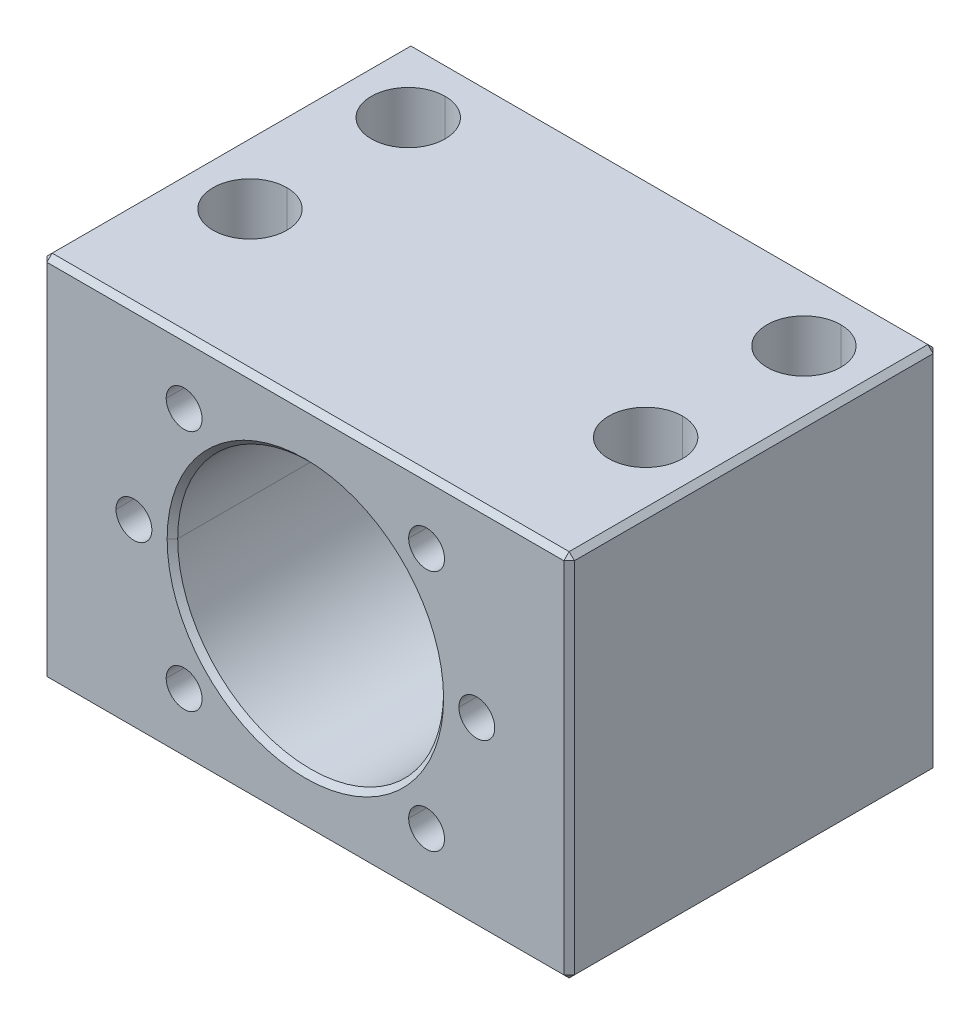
ISO-10303-21;
HEADER;
FILE_DESCRIPTION(('STEP AP214'),'2;1');
FILE_NAME('part.step','',(''),(''),'','','');
FILE_SCHEMA(('AUTOMOTIVE_DESIGN { 1 0 10303 214 1 1 1 1 }'));
ENDSEC;
DATA;
#1=APPLICATION_CONTEXT('core data for automotive mechanical design processes');
#2=APPLICATION_PROTOCOL_DEFINITION('international standard','automotive_design',2000,#1);
#3=PRODUCT_CONTEXT('',#1,'mechanical');
#4=PRODUCT('Part','Part','',(#3));
#5=PRODUCT_RELATED_PRODUCT_CATEGORY('part','',(#4));
#6=PRODUCT_DEFINITION_FORMATION('','',#4);
#7=PRODUCT_DEFINITION_CONTEXT('part definition',#1,'design');
#8=PRODUCT_DEFINITION('design','',#6,#7);
#9=PRODUCT_DEFINITION_SHAPE('','',#8);
#10=(LENGTH_UNIT() NAMED_UNIT(*) SI_UNIT(.MILLI.,.METRE.));
#11=(NAMED_UNIT(*) PLANE_ANGLE_UNIT() SI_UNIT($,.RADIAN.));
#12=(NAMED_UNIT(*) SI_UNIT($,.STERADIAN.) SOLID_ANGLE_UNIT());
#13=UNCERTAINTY_MEASURE_WITH_UNIT(LENGTH_MEASURE(1.E-05),#10,'distance_accuracy_value','');
#14=(GEOMETRIC_REPRESENTATION_CONTEXT(3) GLOBAL_UNCERTAINTY_ASSIGNED_CONTEXT((#13)) GLOBAL_UNIT_ASSIGNED_CONTEXT((#10,
#11,#12)) REPRESENTATION_CONTEXT('',''));
#15=CARTESIAN_POINT('',(0.,0.,0.));
#16=DIRECTION('',(0.,0.,1.));
#17=DIRECTION('',(1.,0.,0.));
#18=AXIS2_PLACEMENT_3D('',#15,#16,#17);
#19=CARTESIAN_POINT('',(-50.,34.,-35.));
#20=DIRECTION('',(0.,-0.707106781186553,0.707106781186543));
#21=DIRECTION('',(-1.,0.,0.));
#22=AXIS2_PLACEMENT_3D('',#19,#20,#21);
#23=PLANE('',#22);
#24=DIRECTION('',(0.,0.707106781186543,0.707106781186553));
#25=VECTOR('',#24,1.);
#26=CARTESIAN_POINT('',(-49.,35.,-34.));
#27=LINE('',#26,#25);
#28=CARTESIAN_POINT('',(-49.,34.,-35.));
#29=VERTEX_POINT('',#28);
#30=CARTESIAN_POINT('',(-49.,35.,-34.));
#31=VERTEX_POINT('',#30);
#32=EDGE_CURVE('E19',#29,#31,#27,.T.);
#33=ORIENTED_EDGE('',*,*,#32,.T.);
#34=DIRECTION('',(-1.,0.,0.));
#35=VECTOR('',#34,1.);
#36=CARTESIAN_POINT('',(-50.,35.,-34.));
#37=LINE('',#36,#35);
#38=CARTESIAN_POINT('',(49.,35.,-34.));
#39=VERTEX_POINT('',#38);
#40=EDGE_CURVE('E585',#39,#31,#37,.T.);
#41=ORIENTED_EDGE('',*,*,#40,.F.);
#42=DIRECTION('',(0.,-0.707106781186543,-0.707106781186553));
#43=VECTOR('',#42,1.);
#44=CARTESIAN_POINT('',(49.,34.,-35.));
#45=LINE('',#44,#43);
#46=CARTESIAN_POINT('',(49.,34.,-35.));
#47=VERTEX_POINT('',#46);
#48=EDGE_CURVE('E10',#39,#47,#45,.T.);
#49=ORIENTED_EDGE('',*,*,#48,.T.);
#50=DIRECTION('',(1.,0.,0.));
#51=VECTOR('',#50,1.);
#52=CARTESIAN_POINT('',(-50.,34.,-35.));
#53=LINE('',#52,#51);
#54=EDGE_CURVE('E588',#29,#47,#53,.T.);
#55=ORIENTED_EDGE('',*,*,#54,.F.);
#56=EDGE_LOOP('',(#33,#41,#49,#55));
#57=FACE_BOUND('',#56,.T.);
#58=ADVANCED_FACE('F16',(#57),#23,.F.);
#59=CARTESIAN_POINT('',(49.,34.,-35.));
#60=DIRECTION('',(0.577350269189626,0.577350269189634,-0.577350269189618));
#61=DIRECTION('',(-0.707106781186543,0.,-0.707106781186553));
#62=AXIS2_PLACEMENT_3D('',#59,#60,#61);
#63=PLANE('',#62);
#64=DIRECTION('',(0.707106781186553,-0.707106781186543,0.));
#65=VECTOR('',#64,1.);
#66=CARTESIAN_POINT('',(49.5,34.5,-34.));
#67=LINE('',#66,#65);
#68=CARTESIAN_POINT('',(50.,34.,-34.));
#69=VERTEX_POINT('',#68);
#70=EDGE_CURVE('E570',#39,#69,#67,.T.);
#71=ORIENTED_EDGE('',*,*,#70,.T.);
#72=DIRECTION('',(-0.707106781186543,0.,-0.707106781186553));
#73=VECTOR('',#72,1.);
#74=CARTESIAN_POINT('',(49.,34.,-35.));
#75=LINE('',#74,#73);
#76=EDGE_CURVE('E567',#69,#47,#75,.T.);
#77=ORIENTED_EDGE('',*,*,#76,.T.);
#78=ORIENTED_EDGE('',*,*,#48,.F.);
#79=EDGE_LOOP('',(#71,#77,#78));
#80=FACE_BOUND('',#79,.T.);
#81=ADVANCED_FACE('F1320',(#80),#63,.T.);
#82=CARTESIAN_POINT('',(-49.,35.,-34.));
#83=DIRECTION('',(-0.577350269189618,0.577350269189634,-0.577350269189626));
#84=DIRECTION('',(-0.707106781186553,0.,0.707106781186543));
#85=AXIS2_PLACEMENT_3D('',#82,#83,#84);
#86=PLANE('',#85);
#87=DIRECTION('',(-0.707106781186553,0.,0.707106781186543));
#88=VECTOR('',#87,1.);
#89=CARTESIAN_POINT('',(-49.5,34.,-34.5));
#90=LINE('',#89,#88);
#91=CARTESIAN_POINT('',(-50.,34.,-34.));
#92=VERTEX_POINT('',#91);
#93=EDGE_CURVE('E522',#29,#92,#90,.T.);
#94=ORIENTED_EDGE('',*,*,#93,.T.);
#95=DIRECTION('',(0.707106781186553,0.707106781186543,0.));
#96=VECTOR('',#95,1.);
#97=CARTESIAN_POINT('',(-49.,35.,-34.));
#98=LINE('',#97,#96);
#99=EDGE_CURVE('E518',#92,#31,#98,.T.);
#100=ORIENTED_EDGE('',*,*,#99,.T.);
#101=ORIENTED_EDGE('',*,*,#32,.F.);
#102=EDGE_LOOP('',(#94,#100,#101));
#103=FACE_BOUND('',#102,.T.);
#104=ADVANCED_FACE('F594',(#103),#86,.T.);
#105=CARTESIAN_POINT('',(50.,34.,35.));
#106=DIRECTION('',(-0.707106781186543,-0.707106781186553,0.));
#107=DIRECTION('',(-0.707106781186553,0.707106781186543,0.));
#108=AXIS2_PLACEMENT_3D('',#105,#106,#107);
#109=PLANE('',#108);
#110=DIRECTION('',(0.707106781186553,-0.707106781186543,0.));
#111=VECTOR('',#110,1.);
#112=CARTESIAN_POINT('',(50.,34.,34.));
#113=LINE('',#112,#111);
#114=CARTESIAN_POINT('',(49.,35.,34.));
#115=VERTEX_POINT('',#114);
#116=CARTESIAN_POINT('',(50.,34.,34.));
#117=VERTEX_POINT('',#116);
#118=EDGE_CURVE('E523',#115,#117,#113,.T.);
#119=ORIENTED_EDGE('',*,*,#118,.T.);
#120=DIRECTION('',(0.,0.,1.));
#121=VECTOR('',#120,1.);
#122=CARTESIAN_POINT('',(50.,34.,35.));
#123=LINE('',#122,#121);
#124=EDGE_CURVE('E638',#69,#117,#123,.T.);
#125=ORIENTED_EDGE('',*,*,#124,.F.);
#126=ORIENTED_EDGE('',*,*,#70,.F.);
#127=DIRECTION('',(0.,0.,-1.));
#128=VECTOR('',#127,1.);
#129=CARTESIAN_POINT('',(49.,35.,35.));
#130=LINE('',#129,#128);
#131=EDGE_CURVE('E606',#115,#39,#130,.T.);
#132=ORIENTED_EDGE('',*,*,#131,.F.);
#133=EDGE_LOOP('',(#119,#125,#126,#132));
#134=FACE_BOUND('',#133,.T.);
#135=ADVANCED_FACE('F1327',(#134),#109,.F.);
#136=CARTESIAN_POINT('',(49.,-35.,-35.));
#137=DIRECTION('',(-0.707106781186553,0.,0.707106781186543));
#138=DIRECTION('',(0.,1.,0.));
#139=AXIS2_PLACEMENT_3D('',#136,#137,#138);
#140=PLANE('',#139);
#141=DIRECTION('',(-0.707106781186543,0.,-0.707106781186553));
#142=VECTOR('',#141,1.);
#143=CARTESIAN_POINT('',(49.,-34.,-35.));
#144=LINE('',#143,#142);
#145=CARTESIAN_POINT('',(50.,-34.,-34.));
#146=VERTEX_POINT('',#145);
#147=CARTESIAN_POINT('',(49.,-34.,-35.));
#148=VERTEX_POINT('',#147);
#149=EDGE_CURVE('E560',#146,#148,#144,.T.);
#150=ORIENTED_EDGE('',*,*,#149,.T.);
#151=DIRECTION('',(0.,-1.,0.));
#152=VECTOR('',#151,1.);
#153=CARTESIAN_POINT('',(49.,-35.,-35.));
#154=LINE('',#153,#152);
#155=EDGE_CURVE('E899',#47,#148,#154,.T.);
#156=ORIENTED_EDGE('',*,*,#155,.F.);
#157=ORIENTED_EDGE('',*,*,#76,.F.);
#158=DIRECTION('',(0.,1.,0.));
#159=VECTOR('',#158,1.);
#160=CARTESIAN_POINT('',(50.,35.,-34.));
#161=LINE('',#160,#159);
#162=EDGE_CURVE('E635',#146,#69,#161,.T.);
#163=ORIENTED_EDGE('',*,*,#162,.F.);
#164=EDGE_LOOP('',(#150,#156,#157,#163));
#165=FACE_BOUND('',#164,.T.);
#166=ADVANCED_FACE('F1330',(#165),#140,.F.);
#167=CARTESIAN_POINT('',(-50.,35.,-34.));
#168=DIRECTION('',(0.707106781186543,0.,0.707106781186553));
#169=DIRECTION('',(0.,-1.,0.));
#170=AXIS2_PLACEMENT_3D('',#167,#168,#169);
#171=PLANE('',#170);
#172=DIRECTION('',(-0.707106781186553,0.,0.707106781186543));
#173=VECTOR('',#172,1.);
#174=CARTESIAN_POINT('',(-50.,-34.,-34.));
#175=LINE('',#174,#173);
#176=CARTESIAN_POINT('',(-49.,-34.,-35.));
#177=VERTEX_POINT('',#176);
#178=CARTESIAN_POINT('',(-50.,-34.,-34.));
#179=VERTEX_POINT('',#178);
#180=EDGE_CURVE('E557',#177,#179,#175,.T.);
#181=ORIENTED_EDGE('',*,*,#180,.T.);
#182=DIRECTION('',(0.,-1.,0.));
#183=VECTOR('',#182,1.);
#184=CARTESIAN_POINT('',(-50.,35.,-34.));
#185=LINE('',#184,#183);
#186=EDGE_CURVE('E393',#92,#179,#185,.T.);
#187=ORIENTED_EDGE('',*,*,#186,.F.);
#188=ORIENTED_EDGE('',*,*,#93,.F.);
#189=DIRECTION('',(0.,1.,0.));
#190=VECTOR('',#189,1.);
#191=CARTESIAN_POINT('',(-49.,-35.,-35.));
#192=LINE('',#191,#190);
#193=EDGE_CURVE('E711',#177,#29,#192,.T.);
#194=ORIENTED_EDGE('',*,*,#193,.F.);
#195=EDGE_LOOP('',(#181,#187,#188,#194));
#196=FACE_BOUND('',#195,.T.);
#197=ADVANCED_FACE('F1333',(#196),#171,.F.);
#198=CARTESIAN_POINT('',(-50.,34.,35.));
#199=DIRECTION('',(0.707106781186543,-0.707106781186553,0.));
#200=DIRECTION('',(0.,0.,-1.));
#201=AXIS2_PLACEMENT_3D('',#198,#199,#200);
#202=PLANE('',#201);
#203=DIRECTION('',(0.707106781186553,0.707106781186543,0.));
#204=VECTOR('',#203,1.);
#205=CARTESIAN_POINT('',(-49.,35.,34.));
#206=LINE('',#205,#204);
#207=CARTESIAN_POINT('',(-50.,34.,34.));
#208=VERTEX_POINT('',#207);
#209=CARTESIAN_POINT('',(-49.,35.,34.));
#210=VERTEX_POINT('',#209);
#211=EDGE_CURVE('E554',#208,#210,#206,.T.);
#212=ORIENTED_EDGE('',*,*,#211,.T.);
#213=DIRECTION('',(0.,0.,1.));
#214=VECTOR('',#213,1.);
#215=CARTESIAN_POINT('',(-49.,35.,35.));
#216=LINE('',#215,#214);
#217=EDGE_CURVE('E597',#31,#210,#216,.T.);
#218=ORIENTED_EDGE('',*,*,#217,.F.);
#219=ORIENTED_EDGE('',*,*,#99,.F.);
#220=DIRECTION('',(0.,0.,-1.));
#221=VECTOR('',#220,1.);
#222=CARTESIAN_POINT('',(-50.,34.,35.));
#223=LINE('',#222,#221);
#224=EDGE_CURVE('E400',#208,#92,#223,.T.);
#225=ORIENTED_EDGE('',*,*,#224,.F.);
#226=EDGE_LOOP('',(#212,#218,#219,#225));
#227=FACE_BOUND('',#226,.T.);
#228=ADVANCED_FACE('F598',(#227),#202,.F.);
#229=CARTESIAN_POINT('',(50.,34.,34.));
#230=DIRECTION('',(0.577350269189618,0.577350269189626,0.577350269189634));
#231=DIRECTION('',(0.707106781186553,-0.707106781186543,0.));
#232=AXIS2_PLACEMENT_3D('',#229,#230,#231);
#233=PLANE('',#232);
#234=DIRECTION('',(0.,-0.707106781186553,0.707106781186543));
#235=VECTOR('',#234,1.);
#236=CARTESIAN_POINT('',(49.,34.5,34.5));
#237=LINE('',#236,#235);
#238=CARTESIAN_POINT('',(49.,34.,35.));
#239=VERTEX_POINT('',#238);
#240=EDGE_CURVE('E551',#115,#239,#237,.T.);
#241=ORIENTED_EDGE('',*,*,#240,.T.);
#242=DIRECTION('',(0.707106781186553,0.,-0.707106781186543));
#243=VECTOR('',#242,1.);
#244=CARTESIAN_POINT('',(50.,34.,34.));
#245=LINE('',#244,#243);
#246=EDGE_CURVE('E543',#239,#117,#245,.T.);
#247=ORIENTED_EDGE('',*,*,#246,.T.);
#248=ORIENTED_EDGE('',*,*,#118,.F.);
#249=EDGE_LOOP('',(#241,#247,#248));
#250=FACE_BOUND('',#249,.T.);
#251=ADVANCED_FACE('F1429',(#250),#233,.T.);
#252=CARTESIAN_POINT('',(49.,-34.,-35.));
#253=DIRECTION('',(0.577350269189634,-0.577350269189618,-0.577350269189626));
#254=DIRECTION('',(0.,-0.707106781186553,0.707106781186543));
#255=AXIS2_PLACEMENT_3D('',#252,#253,#254);
#256=PLANE('',#255);
#257=DIRECTION('',(-0.707106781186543,-0.707106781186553,0.));
#258=VECTOR('',#257,1.);
#259=CARTESIAN_POINT('',(49.5,-34.5,-34.));
#260=LINE('',#259,#258);
#261=CARTESIAN_POINT('',(49.,-35.,-34.));
#262=VERTEX_POINT('',#261);
#263=EDGE_CURVE('E540',#146,#262,#260,.T.);
#264=ORIENTED_EDGE('',*,*,#263,.T.);
#265=DIRECTION('',(0.,0.707106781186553,-0.707106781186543));
#266=VECTOR('',#265,1.);
#267=CARTESIAN_POINT('',(49.,-34.,-35.));
#268=LINE('',#267,#266);
#269=EDGE_CURVE('E535',#262,#148,#268,.T.);
#270=ORIENTED_EDGE('',*,*,#269,.T.);
#271=ORIENTED_EDGE('',*,*,#149,.F.);
#272=EDGE_LOOP('',(#264,#270,#271));
#273=FACE_BOUND('',#272,.T.);
#274=ADVANCED_FACE('F1342',(#273),#256,.T.);
#275=CARTESIAN_POINT('',(-50.,-34.,-34.));
#276=DIRECTION('',(-0.577350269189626,-0.577350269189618,-0.577350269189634));
#277=DIRECTION('',(-0.707106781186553,0.,0.707106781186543));
#278=AXIS2_PLACEMENT_3D('',#275,#276,#277);
#279=PLANE('',#278);
#280=DIRECTION('',(0.,-0.707106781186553,0.707106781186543));
#281=VECTOR('',#280,1.);
#282=CARTESIAN_POINT('',(-49.,-34.5,-34.5));
#283=LINE('',#282,#281);
#284=CARTESIAN_POINT('',(-49.,-35.,-34.));
#285=VERTEX_POINT('',#284);
#286=EDGE_CURVE('E539',#177,#285,#283,.T.);
#287=ORIENTED_EDGE('',*,*,#286,.T.);
#288=DIRECTION('',(-0.707106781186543,0.707106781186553,0.));
#289=VECTOR('',#288,1.);
#290=CARTESIAN_POINT('',(-50.,-34.,-34.));
#291=LINE('',#290,#289);
#292=EDGE_CURVE('E531',#285,#179,#291,.T.);
#293=ORIENTED_EDGE('',*,*,#292,.T.);
#294=ORIENTED_EDGE('',*,*,#180,.F.);
#295=EDGE_LOOP('',(#287,#293,#294));
#296=FACE_BOUND('',#295,.T.);
#297=ADVANCED_FACE('F1338',(#296),#279,.T.);
#298=CARTESIAN_POINT('',(-49.,35.,34.));
#299=DIRECTION('',(-0.577350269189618,0.577350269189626,0.577350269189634));
#300=DIRECTION('',(0.707106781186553,0.707106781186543,0.));
#301=AXIS2_PLACEMENT_3D('',#298,#299,#300);
#302=PLANE('',#301);
#303=DIRECTION('',(0.707106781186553,0.,0.707106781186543));
#304=VECTOR('',#303,1.);
#305=CARTESIAN_POINT('',(-49.5,34.,34.5));
#306=LINE('',#305,#304);
#307=CARTESIAN_POINT('',(-49.,34.,35.));
#308=VERTEX_POINT('',#307);
#309=EDGE_CURVE('E384',#208,#308,#306,.T.);
#310=ORIENTED_EDGE('',*,*,#309,.T.);
#311=DIRECTION('',(0.,0.707106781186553,-0.707106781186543));
#312=VECTOR('',#311,1.);
#313=CARTESIAN_POINT('',(-49.,35.,34.));
#314=LINE('',#313,#312);
#315=EDGE_CURVE('E547',#308,#210,#314,.T.);
#316=ORIENTED_EDGE('',*,*,#315,.T.);
#317=ORIENTED_EDGE('',*,*,#211,.F.);
#318=EDGE_LOOP('',(#310,#316,#317));
#319=FACE_BOUND('',#318,.T.);
#320=ADVANCED_FACE('F1341',(#319),#302,.T.);
#321=CARTESIAN_POINT('',(-50.,34.,35.));
#322=DIRECTION('',(0.,0.707106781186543,0.707106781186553));
#323=DIRECTION('',(1.,0.,0.));
#324=AXIS2_PLACEMENT_3D('',#321,#322,#323);
#325=PLANE('',#324);
#326=ORIENTED_EDGE('',*,*,#315,.F.);
#327=DIRECTION('',(-1.,0.,0.));
#328=VECTOR('',#327,1.);
#329=CARTESIAN_POINT('',(-50.,34.,35.));
#330=LINE('',#329,#328);
#331=EDGE_CURVE('E773',#239,#308,#330,.T.);
#332=ORIENTED_EDGE('',*,*,#331,.F.);
#333=ORIENTED_EDGE('',*,*,#240,.F.);
#334=DIRECTION('',(1.,0.,0.));
#335=VECTOR('',#334,1.);
#336=CARTESIAN_POINT('',(50.,35.,34.));
#337=LINE('',#336,#335);
#338=EDGE_CURVE('E602',#210,#115,#337,.T.);
#339=ORIENTED_EDGE('',*,*,#338,.F.);
#340=EDGE_LOOP('',(#326,#332,#333,#339));
#341=FACE_BOUND('',#340,.T.);
#342=ADVANCED_FACE('F1346',(#341),#325,.T.);
#343=CARTESIAN_POINT('',(50.,35.,34.));
#344=DIRECTION('',(0.707106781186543,0.,0.707106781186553));
#345=DIRECTION('',(0.,-1.,0.));
#346=AXIS2_PLACEMENT_3D('',#343,#344,#345);
#347=PLANE('',#346);
#348=DIRECTION('',(0.707106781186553,0.,-0.707106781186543));
#349=VECTOR('',#348,1.);
#350=CARTESIAN_POINT('',(49.5,-34.,34.5));
#351=LINE('',#350,#349);
#352=CARTESIAN_POINT('',(49.,-34.,35.));
#353=VERTEX_POINT('',#352);
#354=CARTESIAN_POINT('',(50.,-34.,34.));
#355=VERTEX_POINT('',#354);
#356=EDGE_CURVE('E364',#353,#355,#351,.T.);
#357=ORIENTED_EDGE('',*,*,#356,.T.);
#358=DIRECTION('',(0.,-1.,0.));
#359=VECTOR('',#358,1.);
#360=CARTESIAN_POINT('',(50.,-35.,34.));
#361=LINE('',#360,#359);
#362=EDGE_CURVE('E640',#117,#355,#361,.T.);
#363=ORIENTED_EDGE('',*,*,#362,.F.);
#364=ORIENTED_EDGE('',*,*,#246,.F.);
#365=DIRECTION('',(0.,1.,0.));
#366=VECTOR('',#365,1.);
#367=CARTESIAN_POINT('',(49.,35.,35.));
#368=LINE('',#367,#366);
#369=EDGE_CURVE('E806',#353,#239,#368,.T.);
#370=ORIENTED_EDGE('',*,*,#369,.F.);
#371=EDGE_LOOP('',(#357,#363,#364,#370));
#372=FACE_BOUND('',#371,.T.);
#373=ADVANCED_FACE('F1350',(#372),#347,.T.);
#374=CARTESIAN_POINT('',(49.,-35.,0.));
#375=DIRECTION('',(0.707106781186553,-0.707106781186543,0.));
#376=DIRECTION('',(0.,0.,-1.));
#377=AXIS2_PLACEMENT_3D('',#374,#375,#376);
#378=PLANE('',#377);
#379=DIRECTION('',(-0.707106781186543,-0.707106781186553,0.));
#380=VECTOR('',#379,1.);
#381=CARTESIAN_POINT('',(49.,-35.,34.));
#382=LINE('',#381,#380);
#383=CARTESIAN_POINT('',(49.,-35.,34.));
#384=VERTEX_POINT('',#383);
#385=EDGE_CURVE('E39',#355,#384,#382,.T.);
#386=ORIENTED_EDGE('',*,*,#385,.T.);
#387=DIRECTION('',(0.,0.,1.));
#388=VECTOR('',#387,1.);
#389=CARTESIAN_POINT('',(49.,-35.,35.));
#390=LINE('',#389,#388);
#391=EDGE_CURVE('E492',#262,#384,#390,.T.);
#392=ORIENTED_EDGE('',*,*,#391,.F.);
#393=ORIENTED_EDGE('',*,*,#263,.F.);
#394=DIRECTION('',(0.,0.,-1.));
#395=VECTOR('',#394,1.);
#396=CARTESIAN_POINT('',(50.,-34.,-35.));
#397=LINE('',#396,#395);
#398=EDGE_CURVE('E631',#355,#146,#397,.T.);
#399=ORIENTED_EDGE('',*,*,#398,.F.);
#400=EDGE_LOOP('',(#386,#392,#393,#399));
#401=FACE_BOUND('',#400,.T.);
#402=ADVANCED_FACE('F1354',(#401),#378,.T.);
#403=CARTESIAN_POINT('',(0.,-35.,-34.));
#404=DIRECTION('',(0.,-0.707106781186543,-0.707106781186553));
#405=DIRECTION('',(0.,-0.707106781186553,0.707106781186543));
#406=AXIS2_PLACEMENT_3D('',#403,#404,#405);
#407=PLANE('',#406);
#408=ORIENTED_EDGE('',*,*,#269,.F.);
#409=DIRECTION('',(1.,0.,0.));
#410=VECTOR('',#409,1.);
#411=CARTESIAN_POINT('',(50.,-35.,-34.));
#412=LINE('',#411,#410);
#413=EDGE_CURVE('E488',#285,#262,#412,.T.);
#414=ORIENTED_EDGE('',*,*,#413,.F.);
#415=ORIENTED_EDGE('',*,*,#286,.F.);
#416=DIRECTION('',(-1.,0.,0.));
#417=VECTOR('',#416,1.);
#418=CARTESIAN_POINT('',(-50.,-34.,-35.));
#419=LINE('',#418,#417);
#420=EDGE_CURVE('E860',#148,#177,#419,.T.);
#421=ORIENTED_EDGE('',*,*,#420,.F.);
#422=EDGE_LOOP('',(#408,#414,#415,#421));
#423=FACE_BOUND('',#422,.T.);
#424=ADVANCED_FACE('F1567',(#423),#407,.T.);
#425=CARTESIAN_POINT('',(-49.,-35.,0.));
#426=DIRECTION('',(-0.707106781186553,-0.707106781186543,0.));
#427=DIRECTION('',(-0.707106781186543,0.707106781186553,0.));
#428=AXIS2_PLACEMENT_3D('',#425,#426,#427);
#429=PLANE('',#428);
#430=DIRECTION('',(-0.707106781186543,0.707106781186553,0.));
#431=VECTOR('',#430,1.);
#432=CARTESIAN_POINT('',(-50.,-34.,34.));
#433=LINE('',#432,#431);
#434=CARTESIAN_POINT('',(-49.,-35.,34.));
#435=VERTEX_POINT('',#434);
#436=CARTESIAN_POINT('',(-50.,-34.,34.));
#437=VERTEX_POINT('',#436);
#438=EDGE_CURVE('E356',#435,#437,#433,.T.);
#439=ORIENTED_EDGE('',*,*,#438,.T.);
#440=DIRECTION('',(0.,0.,1.));
#441=VECTOR('',#440,1.);
#442=CARTESIAN_POINT('',(-50.,-34.,35.));
#443=LINE('',#442,#441);
#444=EDGE_CURVE('E372',#179,#437,#443,.T.);
#445=ORIENTED_EDGE('',*,*,#444,.F.);
#446=ORIENTED_EDGE('',*,*,#292,.F.);
#447=DIRECTION('',(0.,0.,-1.));
#448=VECTOR('',#447,1.);
#449=CARTESIAN_POINT('',(-49.,-35.,-35.));
#450=LINE('',#449,#448);
#451=EDGE_CURVE('E375',#435,#285,#450,.T.);
#452=ORIENTED_EDGE('',*,*,#451,.F.);
#453=EDGE_LOOP('',(#439,#445,#446,#452));
#454=FACE_BOUND('',#453,.T.);
#455=ADVANCED_FACE('F369',(#454),#429,.T.);
#456=CARTESIAN_POINT('',(-49.,-35.,35.));
#457=DIRECTION('',(-0.707106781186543,0.,0.707106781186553));
#458=DIRECTION('',(0.,1.,0.));
#459=AXIS2_PLACEMENT_3D('',#456,#457,#458);
#460=PLANE('',#459);
#461=DIRECTION('',(0.707106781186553,0.,0.707106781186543));
#462=VECTOR('',#461,1.);
#463=CARTESIAN_POINT('',(-50.,-34.,34.));
#464=LINE('',#463,#462);
#465=CARTESIAN_POINT('',(-49.,-34.,35.));
#466=VERTEX_POINT('',#465);
#467=EDGE_CURVE('E353',#437,#466,#464,.T.);
#468=ORIENTED_EDGE('',*,*,#467,.T.);
#469=DIRECTION('',(0.,-1.,0.));
#470=VECTOR('',#469,1.);
#471=CARTESIAN_POINT('',(-49.,-35.,35.));
#472=LINE('',#471,#470);
#473=EDGE_CURVE('E769',#308,#466,#472,.T.);
#474=ORIENTED_EDGE('',*,*,#473,.F.);
#475=ORIENTED_EDGE('',*,*,#309,.F.);
#476=DIRECTION('',(0.,1.,0.));
#477=VECTOR('',#476,1.);
#478=CARTESIAN_POINT('',(-50.,35.,34.));
#479=LINE('',#478,#477);
#480=EDGE_CURVE('E381',#437,#208,#479,.T.);
#481=ORIENTED_EDGE('',*,*,#480,.F.);
#482=EDGE_LOOP('',(#468,#474,#475,#481));
#483=FACE_BOUND('',#482,.T.);
#484=ADVANCED_FACE('F382',(#483),#460,.T.);
#485=CARTESIAN_POINT('',(49.,-35.,34.));
#486=DIRECTION('',(0.577350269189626,-0.577350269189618,0.577350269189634));
#487=DIRECTION('',(-0.707106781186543,-0.707106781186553,0.));
#488=AXIS2_PLACEMENT_3D('',#485,#486,#487);
#489=PLANE('',#488);
#490=ORIENTED_EDGE('',*,*,#356,.F.);
#491=DIRECTION('',(0.,-0.707106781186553,-0.707106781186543));
#492=VECTOR('',#491,1.);
#493=CARTESIAN_POINT('',(49.,-35.,34.));
#494=LINE('',#493,#492);
#495=EDGE_CURVE('E377',#353,#384,#494,.T.);
#496=ORIENTED_EDGE('',*,*,#495,.T.);
#497=ORIENTED_EDGE('',*,*,#385,.F.);
#498=EDGE_LOOP('',(#490,#496,#497));
#499=FACE_BOUND('',#498,.T.);
#500=ADVANCED_FACE('F1359',(#499),#489,.T.);
#501=CARTESIAN_POINT('',(-50.,-34.,34.));
#502=DIRECTION('',(-0.577350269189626,-0.577350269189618,0.577350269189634));
#503=DIRECTION('',(-0.707106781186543,0.707106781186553,0.));
#504=AXIS2_PLACEMENT_3D('',#501,#502,#503);
#505=PLANE('',#504);
#506=ORIENTED_EDGE('',*,*,#438,.F.);
#507=DIRECTION('',(0.,0.707106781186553,0.707106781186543));
#508=VECTOR('',#507,1.);
#509=CARTESIAN_POINT('',(-49.,-34.5,34.5));
#510=LINE('',#509,#508);
#511=EDGE_CURVE('E358',#435,#466,#510,.T.);
#512=ORIENTED_EDGE('',*,*,#511,.T.);
#513=ORIENTED_EDGE('',*,*,#467,.F.);
#514=EDGE_LOOP('',(#506,#512,#513));
#515=FACE_BOUND('',#514,.T.);
#516=ADVANCED_FACE('F355',(#515),#505,.T.);
#517=CARTESIAN_POINT('',(0.,-35.,34.));
#518=DIRECTION('',(0.,0.707106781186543,-0.707106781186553));
#519=DIRECTION('',(-1.,0.,0.));
#520=AXIS2_PLACEMENT_3D('',#517,#518,#519);
#521=PLANE('',#520);
#522=ORIENTED_EDGE('',*,*,#511,.F.);
#523=DIRECTION('',(-1.,0.,0.));
#524=VECTOR('',#523,1.);
#525=CARTESIAN_POINT('',(0.,-35.,34.));
#526=LINE('',#525,#524);
#527=EDGE_CURVE('E496',#384,#435,#526,.T.);
#528=ORIENTED_EDGE('',*,*,#527,.F.);
#529=ORIENTED_EDGE('',*,*,#495,.F.);
#530=DIRECTION('',(1.,0.,0.));
#531=VECTOR('',#530,1.);
#532=CARTESIAN_POINT('',(-50.,-34.,35.));
#533=LINE('',#532,#531);
#534=EDGE_CURVE('E810',#466,#353,#533,.T.);
#535=ORIENTED_EDGE('',*,*,#534,.F.);
#536=EDGE_LOOP('',(#522,#528,#529,#535));
#537=FACE_BOUND('',#536,.T.);
#538=ADVANCED_FACE('F1358',(#537),#521,.F.);
#539=CARTESIAN_POINT('',(-37.5,-34.5,8.));
#540=DIRECTION('',(0.,-1.,0.));
#541=DIRECTION('',(0.,0.,-1.));
#542=AXIS2_PLACEMENT_3D('',#539,#540,#541);
#543=CONICAL_SURFACE('',#542,10.,0.785398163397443);
#544=DIRECTION('',(0.,-0.707106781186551,0.707106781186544));
#545=VECTOR('',#544,1.);
#546=CARTESIAN_POINT('',(-37.5,-34.5,18.));
#547=LINE('',#546,#545);
#548=CARTESIAN_POINT('',(-37.5,-34.5,18.));
#549=VERTEX_POINT('',#548);
#550=CARTESIAN_POINT('',(-37.5,-35.,18.5));
#551=VERTEX_POINT('',#550);
#552=EDGE_CURVE('E2929',#549,#551,#547,.T.);
#553=ORIENTED_EDGE('',*,*,#552,.F.);
#554=CARTESIAN_POINT('',(-37.5,-34.5,8.));
#555=DIRECTION('',(0.,-1.,0.));
#556=DIRECTION('',(0.,0.,-1.));
#557=AXIS2_PLACEMENT_3D('',#554,#555,#556);
#558=CIRCLE('',#557,10.);
#559=CARTESIAN_POINT('',(-37.5,-34.5,-2.));
#560=VERTEX_POINT('',#559);
#561=EDGE_CURVE('E474',#560,#549,#558,.T.);
#562=ORIENTED_EDGE('',*,*,#561,.F.);
#563=DIRECTION('',(0.,-0.707106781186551,-0.707106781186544));
#564=VECTOR('',#563,1.);
#565=CARTESIAN_POINT('',(-37.5,-34.5,-2.));
#566=LINE('',#565,#564);
#567=CARTESIAN_POINT('',(-37.5,-35.,-2.50000000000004));
#568=VERTEX_POINT('',#567);
#569=EDGE_CURVE('E2919',#560,#568,#566,.T.);
#570=ORIENTED_EDGE('',*,*,#569,.T.);
#571=CARTESIAN_POINT('',(-37.5,-35.,8.));
#572=DIRECTION('',(0.,1.,0.));
#573=DIRECTION('',(0.,0.,-1.));
#574=AXIS2_PLACEMENT_3D('',#571,#572,#573);
#575=CIRCLE('',#574,10.5);
#576=EDGE_CURVE('E512',#551,#568,#575,.T.);
#577=ORIENTED_EDGE('',*,*,#576,.F.);
#578=EDGE_LOOP('',(#553,#562,#570,#577));
#579=FACE_BOUND('',#578,.T.);
#580=ADVANCED_FACE('F1364',(#579),#543,.F.);
#581=CARTESIAN_POINT('',(37.5,-34.5,8.));
#582=DIRECTION('',(0.,-1.,0.));
#583=DIRECTION('',(0.,0.,-1.));
#584=AXIS2_PLACEMENT_3D('',#581,#582,#583);
#585=CONICAL_SURFACE('',#584,10.,0.785398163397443);
#586=DIRECTION('',(0.,-0.707106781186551,0.707106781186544));
#587=VECTOR('',#586,1.);
#588=CARTESIAN_POINT('',(37.5,-34.5,18.));
#589=LINE('',#588,#587);
#590=CARTESIAN_POINT('',(37.5,-34.5,18.));
#591=VERTEX_POINT('',#590);
#592=CARTESIAN_POINT('',(37.5,-35.,18.5));
#593=VERTEX_POINT('',#592);
#594=EDGE_CURVE('E1180',#591,#593,#589,.T.);
#595=ORIENTED_EDGE('',*,*,#594,.F.);
#596=CARTESIAN_POINT('',(37.5,-34.5,8.));
#597=DIRECTION('',(0.,-1.,0.));
#598=DIRECTION('',(0.,0.,-1.));
#599=AXIS2_PLACEMENT_3D('',#596,#597,#598);
#600=CIRCLE('',#599,10.);
#601=CARTESIAN_POINT('',(37.5,-34.5,-2.));
#602=VERTEX_POINT('',#601);
#603=EDGE_CURVE('E463',#602,#591,#600,.T.);
#604=ORIENTED_EDGE('',*,*,#603,.F.);
#605=DIRECTION('',(0.,-0.707106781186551,-0.707106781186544));
#606=VECTOR('',#605,1.);
#607=CARTESIAN_POINT('',(37.5,-34.5,-2.));
#608=LINE('',#607,#606);
#609=CARTESIAN_POINT('',(37.5,-35.,-2.50000000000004));
#610=VERTEX_POINT('',#609);
#611=EDGE_CURVE('E1122',#602,#610,#608,.T.);
#612=ORIENTED_EDGE('',*,*,#611,.T.);
#613=CARTESIAN_POINT('',(37.5,-35.,8.));
#614=DIRECTION('',(0.,1.,0.));
#615=DIRECTION('',(0.,0.,-1.));
#616=AXIS2_PLACEMENT_3D('',#613,#614,#615);
#617=CIRCLE('',#616,10.5);
#618=EDGE_CURVE('E508',#593,#610,#617,.T.);
#619=ORIENTED_EDGE('',*,*,#618,.F.);
#620=EDGE_LOOP('',(#595,#604,#612,#619));
#621=FACE_BOUND('',#620,.T.);
#622=ADVANCED_FACE('F1360',(#621),#585,.F.);
#623=CARTESIAN_POINT('',(37.5,-34.5,-22.));
#624=DIRECTION('',(0.,-1.,0.));
#625=DIRECTION('',(0.,0.,-1.));
#626=AXIS2_PLACEMENT_3D('',#623,#624,#625);
#627=CONICAL_SURFACE('',#626,10.,0.785398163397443);
#628=DIRECTION('',(0.,-0.707106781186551,0.707106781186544));
#629=VECTOR('',#628,1.);
#630=CARTESIAN_POINT('',(37.5,-34.5,-12.));
#631=LINE('',#630,#629);
#632=CARTESIAN_POINT('',(37.5,-34.5,-12.));
#633=VERTEX_POINT('',#632);
#634=CARTESIAN_POINT('',(37.5,-35.,-11.5));
#635=VERTEX_POINT('',#634);
#636=EDGE_CURVE('E1130',#633,#635,#631,.T.);
#637=ORIENTED_EDGE('',*,*,#636,.F.);
#638=CARTESIAN_POINT('',(37.5,-34.5,-22.));
#639=DIRECTION('',(0.,-1.,0.));
#640=DIRECTION('',(0.,0.,-1.));
#641=AXIS2_PLACEMENT_3D('',#638,#639,#640);
#642=CIRCLE('',#641,10.);
#643=CARTESIAN_POINT('',(37.5,-34.5,-32.));
#644=VERTEX_POINT('',#643);
#645=EDGE_CURVE('E478',#644,#633,#642,.T.);
#646=ORIENTED_EDGE('',*,*,#645,.F.);
#647=DIRECTION('',(0.,-0.707106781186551,-0.707106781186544));
#648=VECTOR('',#647,1.);
#649=CARTESIAN_POINT('',(37.5,-34.5,-32.));
#650=LINE('',#649,#648);
#651=CARTESIAN_POINT('',(37.5,-35.,-32.5));
#652=VERTEX_POINT('',#651);
#653=EDGE_CURVE('E1135',#644,#652,#650,.T.);
#654=ORIENTED_EDGE('',*,*,#653,.T.);
#655=CARTESIAN_POINT('',(37.5,-35.,-22.));
#656=DIRECTION('',(0.,1.,0.));
#657=DIRECTION('',(0.,0.,-1.));
#658=AXIS2_PLACEMENT_3D('',#655,#656,#657);
#659=CIRCLE('',#658,10.5);
#660=EDGE_CURVE('E504',#635,#652,#659,.T.);
#661=ORIENTED_EDGE('',*,*,#660,.F.);
#662=EDGE_LOOP('',(#637,#646,#654,#661));
#663=FACE_BOUND('',#662,.T.);
#664=ADVANCED_FACE('F1363',(#663),#627,.F.);
#665=CARTESIAN_POINT('',(-37.5,-34.5,-22.));
#666=DIRECTION('',(0.,-1.,0.));
#667=DIRECTION('',(0.,0.,-1.));
#668=AXIS2_PLACEMENT_3D('',#665,#666,#667);
#669=CONICAL_SURFACE('',#668,10.,0.785398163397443);
#670=DIRECTION('',(0.,-0.707106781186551,0.707106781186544));
#671=VECTOR('',#670,1.);
#672=CARTESIAN_POINT('',(-37.5,-34.5,-12.));
#673=LINE('',#672,#671);
#674=CARTESIAN_POINT('',(-37.5,-34.5,-12.));
#675=VERTEX_POINT('',#674);
#676=CARTESIAN_POINT('',(-37.5,-35.,-11.5));
#677=VERTEX_POINT('',#676);
#678=EDGE_CURVE('E2948',#675,#677,#673,.T.);
#679=ORIENTED_EDGE('',*,*,#678,.F.);
#680=CARTESIAN_POINT('',(-37.5,-34.5,-22.));
#681=DIRECTION('',(0.,-1.,0.));
#682=DIRECTION('',(0.,0.,-1.));
#683=AXIS2_PLACEMENT_3D('',#680,#681,#682);
#684=CIRCLE('',#683,10.);
#685=CARTESIAN_POINT('',(-37.5,-34.5,-32.));
#686=VERTEX_POINT('',#685);
#687=EDGE_CURVE('E482',#686,#675,#684,.T.);
#688=ORIENTED_EDGE('',*,*,#687,.F.);
#689=DIRECTION('',(0.,-0.707106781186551,-0.707106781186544));
#690=VECTOR('',#689,1.);
#691=CARTESIAN_POINT('',(-37.5,-34.5,-32.));
#692=LINE('',#691,#690);
#693=CARTESIAN_POINT('',(-37.5,-35.,-32.5));
#694=VERTEX_POINT('',#693);
#695=EDGE_CURVE('E1113',#686,#694,#692,.T.);
#696=ORIENTED_EDGE('',*,*,#695,.T.);
#697=CARTESIAN_POINT('',(-37.5,-35.,-22.));
#698=DIRECTION('',(0.,1.,0.));
#699=DIRECTION('',(0.,0.,-1.));
#700=AXIS2_PLACEMENT_3D('',#697,#698,#699);
#701=CIRCLE('',#700,10.5);
#702=EDGE_CURVE('E500',#677,#694,#701,.T.);
#703=ORIENTED_EDGE('',*,*,#702,.F.);
#704=EDGE_LOOP('',(#679,#688,#696,#703));
#705=FACE_BOUND('',#704,.T.);
#706=ADVANCED_FACE('F1366',(#705),#669,.F.);
#707=CARTESIAN_POINT('',(0.,-35.,0.));
#708=DIRECTION('',(0.,-1.,0.));
#709=DIRECTION('',(0.,0.,-1.));
#710=AXIS2_PLACEMENT_3D('',#707,#708,#709);
#711=PLANE('',#710);
#712=CARTESIAN_POINT('',(-37.5,-35.,8.));
#713=DIRECTION('',(0.,1.,0.));
#714=DIRECTION('',(0.,0.,-1.));
#715=AXIS2_PLACEMENT_3D('',#712,#713,#714);
#716=CIRCLE('',#715,10.5);
#717=EDGE_CURVE('E2924',#568,#551,#716,.T.);
#718=ORIENTED_EDGE('',*,*,#717,.T.);
#719=ORIENTED_EDGE('',*,*,#576,.T.);
#720=EDGE_LOOP('',(#718,#719));
#721=FACE_BOUND('',#720,.T.);
#722=CARTESIAN_POINT('',(37.5,-35.,8.));
#723=DIRECTION('',(0.,1.,0.));
#724=DIRECTION('',(0.,0.,-1.));
#725=AXIS2_PLACEMENT_3D('',#722,#723,#724);
#726=CIRCLE('',#725,10.5);
#727=EDGE_CURVE('E1127',#610,#593,#726,.T.);
#728=ORIENTED_EDGE('',*,*,#727,.T.);
#729=ORIENTED_EDGE('',*,*,#618,.T.);
#730=EDGE_LOOP('',(#728,#729));
#731=FACE_BOUND('',#730,.T.);
#732=CARTESIAN_POINT('',(37.5,-35.,-22.));
#733=DIRECTION('',(0.,1.,0.));
#734=DIRECTION('',(0.,0.,-1.));
#735=AXIS2_PLACEMENT_3D('',#732,#733,#734);
#736=CIRCLE('',#735,10.5);
#737=EDGE_CURVE('E1134',#652,#635,#736,.T.);
#738=ORIENTED_EDGE('',*,*,#737,.T.);
#739=ORIENTED_EDGE('',*,*,#660,.T.);
#740=EDGE_LOOP('',(#738,#739));
#741=FACE_BOUND('',#740,.T.);
#742=CARTESIAN_POINT('',(-37.5,-35.,-22.));
#743=DIRECTION('',(0.,1.,0.));
#744=DIRECTION('',(0.,0.,-1.));
#745=AXIS2_PLACEMENT_3D('',#742,#743,#744);
#746=CIRCLE('',#745,10.5);
#747=EDGE_CURVE('E1118',#694,#677,#746,.T.);
#748=ORIENTED_EDGE('',*,*,#747,.T.);
#749=ORIENTED_EDGE('',*,*,#702,.T.);
#750=EDGE_LOOP('',(#748,#749));
#751=FACE_BOUND('',#750,.T.);
#752=ORIENTED_EDGE('',*,*,#451,.T.);
#753=ORIENTED_EDGE('',*,*,#413,.T.);
#754=ORIENTED_EDGE('',*,*,#391,.T.);
#755=ORIENTED_EDGE('',*,*,#527,.T.);
#756=EDGE_LOOP('',(#752,#753,#754,#755));
#757=FACE_BOUND('',#756,.T.);
#758=ADVANCED_FACE('F1369',(#721,#731,#741,#751,#757),#711,.T.);
#759=CARTESIAN_POINT('',(0.,0.,34.));
#760=DIRECTION('',(0.,0.,1.));
#761=DIRECTION('',(1.,0.,0.));
#762=AXIS2_PLACEMENT_3D('',#759,#760,#761);
#763=CONICAL_SURFACE('',#762,25.2,0.78539816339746);
#764=CARTESIAN_POINT('',(0.,0.,34.));
#765=DIRECTION('',(0.,0.,1.));
#766=DIRECTION('',(1.,0.,0.));
#767=AXIS2_PLACEMENT_3D('',#764,#765,#766);
#768=CIRCLE('',#767,25.2);
#769=CARTESIAN_POINT('',(-25.2,0.,34.));
#770=VERTEX_POINT('',#769);
#771=CARTESIAN_POINT('',(25.2,0.,34.));
#772=VERTEX_POINT('',#771);
#773=EDGE_CURVE('E440',#770,#772,#768,.T.);
#774=ORIENTED_EDGE('',*,*,#773,.F.);
#775=DIRECTION('',(-0.707106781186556,0.,0.707106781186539));
#776=VECTOR('',#775,1.);
#777=CARTESIAN_POINT('',(-25.2,0.,34.));
#778=LINE('',#777,#776);
#779=CARTESIAN_POINT('',(-26.2,0.,35.));
#780=VERTEX_POINT('',#779);
#781=EDGE_CURVE('E944',#770,#780,#778,.T.);
#782=ORIENTED_EDGE('',*,*,#781,.T.);
#783=CARTESIAN_POINT('',(0.,0.,35.));
#784=DIRECTION('',(0.,0.,-1.));
#785=DIRECTION('',(1.,0.,0.));
#786=AXIS2_PLACEMENT_3D('',#783,#784,#785);
#787=CIRCLE('',#786,26.2);
#788=CARTESIAN_POINT('',(26.2,0.,35.));
#789=VERTEX_POINT('',#788);
#790=EDGE_CURVE('E612',#789,#780,#787,.T.);
#791=ORIENTED_EDGE('',*,*,#790,.F.);
#792=DIRECTION('',(0.707106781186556,0.,0.707106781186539));
#793=VECTOR('',#792,1.);
#794=CARTESIAN_POINT('',(25.2,0.,34.));
#795=LINE('',#794,#793);
#796=EDGE_CURVE('E945',#772,#789,#795,.T.);
#797=ORIENTED_EDGE('',*,*,#796,.F.);
#798=EDGE_LOOP('',(#774,#782,#791,#797));
#799=FACE_BOUND('',#798,.T.);
#800=ADVANCED_FACE('F950',(#799),#763,.F.);
#801=CARTESIAN_POINT('',(0.,0.,-35.));
#802=DIRECTION('',(0.,0.,-1.));
#803=DIRECTION('',(-1.,0.,0.));
#804=AXIS2_PLACEMENT_3D('',#801,#802,#803);
#805=CONICAL_SURFACE('',#804,26.2,0.78539816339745);
#806=CARTESIAN_POINT('',(0.,0.,-34.));
#807=DIRECTION('',(0.,0.,-1.));
#808=DIRECTION('',(1.,0.,0.));
#809=AXIS2_PLACEMENT_3D('',#806,#807,#808);
#810=CIRCLE('',#809,25.2);
#811=CARTESIAN_POINT('',(25.2,0.,-34.));
#812=VERTEX_POINT('',#811);
#813=CARTESIAN_POINT('',(-25.2,0.,-34.));
#814=VERTEX_POINT('',#813);
#815=EDGE_CURVE('E439',#812,#814,#810,.T.);
#816=ORIENTED_EDGE('',*,*,#815,.F.);
#817=DIRECTION('',(0.707106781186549,0.,-0.707106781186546));
#818=VECTOR('',#817,1.);
#819=CARTESIAN_POINT('',(26.2,0.,-35.));
#820=LINE('',#819,#818);
#821=CARTESIAN_POINT('',(26.2,0.,-35.));
#822=VERTEX_POINT('',#821);
#823=EDGE_CURVE('E947',#812,#822,#820,.T.);
#824=ORIENTED_EDGE('',*,*,#823,.T.);
#825=CARTESIAN_POINT('',(0.,0.,-35.));
#826=DIRECTION('',(0.,0.,1.));
#827=DIRECTION('',(1.,0.,0.));
#828=AXIS2_PLACEMENT_3D('',#825,#826,#827);
#829=CIRCLE('',#828,26.2);
#830=CARTESIAN_POINT('',(-26.2,0.,-35.));
#831=VERTEX_POINT('',#830);
#832=EDGE_CURVE('E856',#831,#822,#829,.T.);
#833=ORIENTED_EDGE('',*,*,#832,.F.);
#834=DIRECTION('',(-0.707106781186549,0.,-0.707106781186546));
#835=VECTOR('',#834,1.);
#836=CARTESIAN_POINT('',(-26.2,0.,-35.));
#837=LINE('',#836,#835);
#838=EDGE_CURVE('E979',#814,#831,#837,.T.);
#839=ORIENTED_EDGE('',*,*,#838,.F.);
#840=EDGE_LOOP('',(#816,#824,#833,#839));
#841=FACE_BOUND('',#840,.T.);
#842=ADVANCED_FACE('F1292',(#841),#805,.F.);
#843=CARTESIAN_POINT('',(-37.5,-17.,-22.));
#844=DIRECTION('',(0.,-1.,0.));
#845=DIRECTION('',(0.,0.,-1.));
#846=AXIS2_PLACEMENT_3D('',#843,#844,#845);
#847=CYLINDRICAL_SURFACE('',#846,10.);
#848=DIRECTION('',(0.,-1.,0.));
#849=VECTOR('',#848,1.);
#850=CARTESIAN_POINT('',(-37.5,-17.,-12.));
#851=LINE('',#850,#849);
#852=CARTESIAN_POINT('',(-37.5,-17.,-12.));
#853=VERTEX_POINT('',#852);
#854=EDGE_CURVE('E1146',#853,#675,#851,.T.);
#855=ORIENTED_EDGE('',*,*,#854,.F.);
#856=CARTESIAN_POINT('',(-37.5,-17.,-22.));
#857=DIRECTION('',(0.,-1.,0.));
#858=DIRECTION('',(0.,0.,-1.));
#859=AXIS2_PLACEMENT_3D('',#856,#857,#858);
#860=CIRCLE('',#859,10.);
#861=CARTESIAN_POINT('',(-37.5,-17.,-32.));
#862=VERTEX_POINT('',#861);
#863=EDGE_CURVE('E996',#862,#853,#860,.T.);
#864=ORIENTED_EDGE('',*,*,#863,.F.);
#865=DIRECTION('',(0.,-1.,0.));
#866=VECTOR('',#865,1.);
#867=CARTESIAN_POINT('',(-37.5,-17.,-32.));
#868=LINE('',#867,#866);
#869=EDGE_CURVE('E1153',#862,#686,#868,.T.);
#870=ORIENTED_EDGE('',*,*,#869,.T.);
#871=ORIENTED_EDGE('',*,*,#687,.T.);
#872=EDGE_LOOP('',(#855,#864,#870,#871));
#873=FACE_BOUND('',#872,.T.);
#874=ADVANCED_FACE('F1383',(#873),#847,.F.);
#875=CARTESIAN_POINT('',(37.5,-17.,-22.));
#876=DIRECTION('',(0.,-1.,0.));
#877=DIRECTION('',(0.,0.,-1.));
#878=AXIS2_PLACEMENT_3D('',#875,#876,#877);
#879=CYLINDRICAL_SURFACE('',#878,10.);
#880=DIRECTION('',(0.,-1.,0.));
#881=VECTOR('',#880,1.);
#882=CARTESIAN_POINT('',(37.5,-17.,-12.));
#883=LINE('',#882,#881);
#884=CARTESIAN_POINT('',(37.5,-17.,-12.));
#885=VERTEX_POINT('',#884);
#886=EDGE_CURVE('E1065',#885,#633,#883,.T.);
#887=ORIENTED_EDGE('',*,*,#886,.F.);
#888=CARTESIAN_POINT('',(37.5,-17.,-22.));
#889=DIRECTION('',(0.,-1.,0.));
#890=DIRECTION('',(0.,0.,-1.));
#891=AXIS2_PLACEMENT_3D('',#888,#889,#890);
#892=CIRCLE('',#891,10.);
#893=CARTESIAN_POINT('',(37.5,-17.,-32.));
#894=VERTEX_POINT('',#893);
#895=EDGE_CURVE('E1008',#894,#885,#892,.T.);
#896=ORIENTED_EDGE('',*,*,#895,.F.);
#897=DIRECTION('',(0.,-1.,0.));
#898=VECTOR('',#897,1.);
#899=CARTESIAN_POINT('',(37.5,-17.,-32.));
#900=LINE('',#899,#898);
#901=EDGE_CURVE('E1060',#894,#644,#900,.T.);
#902=ORIENTED_EDGE('',*,*,#901,.T.);
#903=ORIENTED_EDGE('',*,*,#645,.T.);
#904=EDGE_LOOP('',(#887,#896,#902,#903));
#905=FACE_BOUND('',#904,.T.);
#906=ADVANCED_FACE('F1379',(#905),#879,.F.);
#907=CARTESIAN_POINT('',(-37.5,-17.,8.));
#908=DIRECTION('',(0.,-1.,0.));
#909=DIRECTION('',(0.,0.,-1.));
#910=AXIS2_PLACEMENT_3D('',#907,#908,#909);
#911=CYLINDRICAL_SURFACE('',#910,10.);
#912=DIRECTION('',(0.,-1.,0.));
#913=VECTOR('',#912,1.);
#914=CARTESIAN_POINT('',(-37.5,-17.,18.));
#915=LINE('',#914,#913);
#916=CARTESIAN_POINT('',(-37.5,-17.,18.));
#917=VERTEX_POINT('',#916);
#918=EDGE_CURVE('E1070',#917,#549,#915,.T.);
#919=ORIENTED_EDGE('',*,*,#918,.F.);
#920=CARTESIAN_POINT('',(-37.5,-17.,8.));
#921=DIRECTION('',(0.,-1.,0.));
#922=DIRECTION('',(0.,0.,-1.));
#923=AXIS2_PLACEMENT_3D('',#920,#921,#922);
#924=CIRCLE('',#923,10.);
#925=CARTESIAN_POINT('',(-37.5,-17.,-2.));
#926=VERTEX_POINT('',#925);
#927=EDGE_CURVE('E1019',#926,#917,#924,.T.);
#928=ORIENTED_EDGE('',*,*,#927,.F.);
#929=DIRECTION('',(0.,-1.,0.));
#930=VECTOR('',#929,1.);
#931=CARTESIAN_POINT('',(-37.5,-17.,-2.));
#932=LINE('',#931,#930);
#933=EDGE_CURVE('E1080',#926,#560,#932,.T.);
#934=ORIENTED_EDGE('',*,*,#933,.T.);
#935=ORIENTED_EDGE('',*,*,#561,.T.);
#936=EDGE_LOOP('',(#919,#928,#934,#935));
#937=FACE_BOUND('',#936,.T.);
#938=ADVANCED_FACE('F1382',(#937),#911,.F.);
#939=CARTESIAN_POINT('',(-37.5,35.,-22.));
#940=DIRECTION('',(0.,1.,0.));
#941=DIRECTION('',(0.,0.,1.));
#942=AXIS2_PLACEMENT_3D('',#939,#940,#941);
#943=CYLINDRICAL_SURFACE('',#942,7.);
#944=CARTESIAN_POINT('',(-37.5,10.,-22.));
#945=DIRECTION('',(0.,1.,0.));
#946=DIRECTION('',(0.,0.,1.));
#947=AXIS2_PLACEMENT_3D('',#944,#945,#946);
#948=CIRCLE('',#947,7.);
#949=CARTESIAN_POINT('',(-37.5,10.,-29.));
#950=VERTEX_POINT('',#949);
#951=CARTESIAN_POINT('',(-37.5,10.,-15.));
#952=VERTEX_POINT('',#951);
#953=EDGE_CURVE('E471',#950,#952,#948,.T.);
#954=ORIENTED_EDGE('',*,*,#953,.F.);
#955=DIRECTION('',(0.,1.,0.));
#956=VECTOR('',#955,1.);
#957=CARTESIAN_POINT('',(-37.5,35.,-29.));
#958=LINE('',#957,#956);
#959=CARTESIAN_POINT('',(-37.5,35.,-29.));
#960=VERTEX_POINT('',#959);
#961=EDGE_CURVE('E667',#950,#960,#958,.T.);
#962=ORIENTED_EDGE('',*,*,#961,.T.);
#963=CARTESIAN_POINT('',(-37.5,35.,-22.));
#964=DIRECTION('',(0.,1.,0.));
#965=DIRECTION('',(0.,0.,1.));
#966=AXIS2_PLACEMENT_3D('',#963,#964,#965);
#967=CIRCLE('',#966,7.);
#968=CARTESIAN_POINT('',(-37.5,35.,-15.));
#969=VERTEX_POINT('',#968);
#970=EDGE_CURVE('E628',#960,#969,#967,.T.);
#971=ORIENTED_EDGE('',*,*,#970,.T.);
#972=DIRECTION('',(0.,1.,0.));
#973=VECTOR('',#972,1.);
#974=CARTESIAN_POINT('',(-37.5,35.,-15.));
#975=LINE('',#974,#973);
#976=EDGE_CURVE('E675',#952,#969,#975,.T.);
#977=ORIENTED_EDGE('',*,*,#976,.F.);
#978=EDGE_LOOP('',(#954,#962,#971,#977));
#979=FACE_BOUND('',#978,.T.);
#980=ADVANCED_FACE('F1386',(#979),#943,.F.);
#981=CARTESIAN_POINT('',(-37.5,10.,-22.));
#982=DIRECTION('',(0.,1.,0.));
#983=DIRECTION('',(0.,0.,1.));
#984=AXIS2_PLACEMENT_3D('',#981,#982,#983);
#985=CONICAL_SURFACE('',#984,7.,1.02974425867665);
#986=CARTESIAN_POINT('',(-37.5,9.69956969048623,-22.));
#987=DIRECTION('',(0.,-1.,0.));
#988=DIRECTION('',(0.,0.,1.));
#989=AXIS2_PLACEMENT_3D('',#986,#987,#988);
#990=CIRCLE('',#989,6.5);
#991=CARTESIAN_POINT('',(-37.5,9.69956969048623,-15.5));
#992=VERTEX_POINT('',#991);
#993=CARTESIAN_POINT('',(-37.5,9.69956969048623,-28.5));
#994=VERTEX_POINT('',#993);
#995=EDGE_CURVE('E426',#992,#994,#990,.T.);
#996=ORIENTED_EDGE('',*,*,#995,.T.);
#997=DIRECTION('',(0.,0.515038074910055,-0.857167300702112));
#998=VECTOR('',#997,1.);
#999=CARTESIAN_POINT('',(-37.5,10.,-29.));
#1000=LINE('',#999,#998);
#1001=EDGE_CURVE('E693',#994,#950,#1000,.T.);
#1002=ORIENTED_EDGE('',*,*,#1001,.T.);
#1003=ORIENTED_EDGE('',*,*,#953,.T.);
#1004=DIRECTION('',(0.,0.515038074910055,0.857167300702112));
#1005=VECTOR('',#1004,1.);
#1006=CARTESIAN_POINT('',(-37.5,10.,-15.));
#1007=LINE('',#1006,#1005);
#1008=EDGE_CURVE('E692',#992,#952,#1007,.T.);
#1009=ORIENTED_EDGE('',*,*,#1008,.F.);
#1010=EDGE_LOOP('',(#996,#1002,#1003,#1009));
#1011=FACE_BOUND('',#1010,.T.);
#1012=ADVANCED_FACE('F1390',(#1011),#985,.F.);
#1013=CARTESIAN_POINT('',(37.5,35.,-22.));
#1014=DIRECTION('',(0.,1.,0.));
#1015=DIRECTION('',(0.,0.,1.));
#1016=AXIS2_PLACEMENT_3D('',#1013,#1014,#1015);
#1017=CYLINDRICAL_SURFACE('',#1016,7.);
#1018=CARTESIAN_POINT('',(37.5,10.,-22.));
#1019=DIRECTION('',(0.,1.,0.));
#1020=DIRECTION('',(0.,0.,1.));
#1021=AXIS2_PLACEMENT_3D('',#1018,#1019,#1020);
#1022=CIRCLE('',#1021,7.);
#1023=CARTESIAN_POINT('',(37.5,10.,-29.));
#1024=VERTEX_POINT('',#1023);
#1025=CARTESIAN_POINT('',(37.5,10.,-15.));
#1026=VERTEX_POINT('',#1025);
#1027=EDGE_CURVE('E470',#1024,#1026,#1022,.T.);
#1028=ORIENTED_EDGE('',*,*,#1027,.F.);
#1029=DIRECTION('',(0.,1.,0.));
#1030=VECTOR('',#1029,1.);
#1031=CARTESIAN_POINT('',(37.5,35.,-29.));
#1032=LINE('',#1031,#1030);
#1033=CARTESIAN_POINT('',(37.5,35.,-29.));
#1034=VERTEX_POINT('',#1033);
#1035=EDGE_CURVE('E702',#1024,#1034,#1032,.T.);
#1036=ORIENTED_EDGE('',*,*,#1035,.T.);
#1037=CARTESIAN_POINT('',(37.5,35.,-22.));
#1038=DIRECTION('',(0.,1.,0.));
#1039=DIRECTION('',(0.,0.,1.));
#1040=AXIS2_PLACEMENT_3D('',#1037,#1038,#1039);
#1041=CIRCLE('',#1040,7.);
#1042=CARTESIAN_POINT('',(37.5,35.,-15.));
#1043=VERTEX_POINT('',#1042);
#1044=EDGE_CURVE('E622',#1034,#1043,#1041,.T.);
#1045=ORIENTED_EDGE('',*,*,#1044,.T.);
#1046=DIRECTION('',(0.,1.,0.));
#1047=VECTOR('',#1046,1.);
#1048=CARTESIAN_POINT('',(37.5,35.,-15.));
#1049=LINE('',#1048,#1047);
#1050=EDGE_CURVE('E710',#1026,#1043,#1049,.T.);
#1051=ORIENTED_EDGE('',*,*,#1050,.F.);
#1052=EDGE_LOOP('',(#1028,#1036,#1045,#1051));
#1053=FACE_BOUND('',#1052,.T.);
#1054=ADVANCED_FACE('F1394',(#1053),#1017,.F.);
#1055=CARTESIAN_POINT('',(37.5,10.,-22.));
#1056=DIRECTION('',(0.,1.,0.));
#1057=DIRECTION('',(0.,0.,1.));
#1058=AXIS2_PLACEMENT_3D('',#1055,#1056,#1057);
#1059=CONICAL_SURFACE('',#1058,7.,1.02974425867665);
#1060=CARTESIAN_POINT('',(37.5,9.69956969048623,-22.));
#1061=DIRECTION('',(0.,-1.,0.));
#1062=DIRECTION('',(0.,0.,1.));
#1063=AXIS2_PLACEMENT_3D('',#1060,#1061,#1062);
#1064=CIRCLE('',#1063,6.5);
#1065=CARTESIAN_POINT('',(37.5,9.69956969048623,-15.5));
#1066=VERTEX_POINT('',#1065);
#1067=CARTESIAN_POINT('',(37.5,9.69956969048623,-28.5));
#1068=VERTEX_POINT('',#1067);
#1069=EDGE_CURVE('E429',#1066,#1068,#1064,.T.);
#1070=ORIENTED_EDGE('',*,*,#1069,.T.);
#1071=DIRECTION('',(0.,0.515038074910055,-0.857167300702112));
#1072=VECTOR('',#1071,1.);
#1073=CARTESIAN_POINT('',(37.5,10.,-29.));
#1074=LINE('',#1073,#1072);
#1075=EDGE_CURVE('E715',#1068,#1024,#1074,.T.);
#1076=ORIENTED_EDGE('',*,*,#1075,.T.);
#1077=ORIENTED_EDGE('',*,*,#1027,.T.);
#1078=DIRECTION('',(0.,0.515038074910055,0.857167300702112));
#1079=VECTOR('',#1078,1.);
#1080=CARTESIAN_POINT('',(37.5,10.,-15.));
#1081=LINE('',#1080,#1079);
#1082=EDGE_CURVE('E725',#1066,#1026,#1081,.T.);
#1083=ORIENTED_EDGE('',*,*,#1082,.F.);
#1084=EDGE_LOOP('',(#1070,#1076,#1077,#1083));
#1085=FACE_BOUND('',#1084,.T.);
#1086=ADVANCED_FACE('F1398',(#1085),#1059,.F.);
#1087=CARTESIAN_POINT('',(-37.5,35.,8.));
#1088=DIRECTION('',(0.,1.,0.));
#1089=DIRECTION('',(0.,0.,1.));
#1090=AXIS2_PLACEMENT_3D('',#1087,#1088,#1089);
#1091=CYLINDRICAL_SURFACE('',#1090,7.);
#1092=CARTESIAN_POINT('',(-37.5,10.,8.));
#1093=DIRECTION('',(0.,1.,0.));
#1094=DIRECTION('',(0.,0.,1.));
#1095=AXIS2_PLACEMENT_3D('',#1092,#1093,#1094);
#1096=CIRCLE('',#1095,7.);
#1097=CARTESIAN_POINT('',(-37.5,10.,1.));
#1098=VERTEX_POINT('',#1097);
#1099=CARTESIAN_POINT('',(-37.5,10.,15.));
#1100=VERTEX_POINT('',#1099);
#1101=EDGE_CURVE('E467',#1098,#1100,#1096,.T.);
#1102=ORIENTED_EDGE('',*,*,#1101,.F.);
#1103=DIRECTION('',(0.,1.,0.));
#1104=VECTOR('',#1103,1.);
#1105=CARTESIAN_POINT('',(-37.5,35.,1.));
#1106=LINE('',#1105,#1104);
#1107=CARTESIAN_POINT('',(-37.5,35.,0.999999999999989));
#1108=VERTEX_POINT('',#1107);
#1109=EDGE_CURVE('E729',#1098,#1108,#1106,.T.);
#1110=ORIENTED_EDGE('',*,*,#1109,.T.);
#1111=CARTESIAN_POINT('',(-37.5,35.,8.));
#1112=DIRECTION('',(0.,1.,0.));
#1113=DIRECTION('',(0.,0.,1.));
#1114=AXIS2_PLACEMENT_3D('',#1111,#1112,#1113);
#1115=CIRCLE('',#1114,7.);
#1116=CARTESIAN_POINT('',(-37.5,35.,15.));
#1117=VERTEX_POINT('',#1116);
#1118=EDGE_CURVE('E619',#1108,#1117,#1115,.T.);
#1119=ORIENTED_EDGE('',*,*,#1118,.T.);
#1120=DIRECTION('',(0.,1.,0.));
#1121=VECTOR('',#1120,1.);
#1122=CARTESIAN_POINT('',(-37.5,35.,15.));
#1123=LINE('',#1122,#1121);
#1124=EDGE_CURVE('E740',#1100,#1117,#1123,.T.);
#1125=ORIENTED_EDGE('',*,*,#1124,.F.);
#1126=EDGE_LOOP('',(#1102,#1110,#1119,#1125));
#1127=FACE_BOUND('',#1126,.T.);
#1128=ADVANCED_FACE('F1400',(#1127),#1091,.F.);
#1129=CARTESIAN_POINT('',(-37.5,10.,8.));
#1130=DIRECTION('',(0.,1.,0.));
#1131=DIRECTION('',(0.,0.,1.));
#1132=AXIS2_PLACEMENT_3D('',#1129,#1130,#1131);
#1133=CONICAL_SURFACE('',#1132,7.,1.02974425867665);
#1134=CARTESIAN_POINT('',(-37.5,9.69956969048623,8.));
#1135=DIRECTION('',(0.,-1.,0.));
#1136=DIRECTION('',(0.,0.,1.));
#1137=AXIS2_PLACEMENT_3D('',#1134,#1135,#1136);
#1138=CIRCLE('',#1137,6.5);
#1139=CARTESIAN_POINT('',(-37.5,9.69956969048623,14.5));
#1140=VERTEX_POINT('',#1139);
#1141=CARTESIAN_POINT('',(-37.5,9.69956969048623,1.49999999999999));
#1142=VERTEX_POINT('',#1141);
#1143=EDGE_CURVE('E433',#1140,#1142,#1138,.T.);
#1144=ORIENTED_EDGE('',*,*,#1143,.T.);
#1145=DIRECTION('',(0.,0.515038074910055,-0.857167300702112));
#1146=VECTOR('',#1145,1.);
#1147=CARTESIAN_POINT('',(-37.5,10.,1.));
#1148=LINE('',#1147,#1146);
#1149=EDGE_CURVE('E749',#1142,#1098,#1148,.T.);
#1150=ORIENTED_EDGE('',*,*,#1149,.T.);
#1151=ORIENTED_EDGE('',*,*,#1101,.T.);
#1152=DIRECTION('',(0.,0.515038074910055,0.857167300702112));
#1153=VECTOR('',#1152,1.);
#1154=CARTESIAN_POINT('',(-37.5,10.,15.));
#1155=LINE('',#1154,#1153);
#1156=EDGE_CURVE('E754',#1140,#1100,#1155,.T.);
#1157=ORIENTED_EDGE('',*,*,#1156,.F.);
#1158=EDGE_LOOP('',(#1144,#1150,#1151,#1157));
#1159=FACE_BOUND('',#1158,.T.);
#1160=ADVANCED_FACE('F1403',(#1159),#1133,.F.);
#1161=CARTESIAN_POINT('',(37.5,-17.,8.));
#1162=DIRECTION('',(0.,-1.,0.));
#1163=DIRECTION('',(0.,0.,-1.));
#1164=AXIS2_PLACEMENT_3D('',#1161,#1162,#1163);
#1165=CYLINDRICAL_SURFACE('',#1164,10.);
#1166=DIRECTION('',(0.,-1.,0.));
#1167=VECTOR('',#1166,1.);
#1168=CARTESIAN_POINT('',(37.5,-17.,18.));
#1169=LINE('',#1168,#1167);
#1170=CARTESIAN_POINT('',(37.5,-17.,18.));
#1171=VERTEX_POINT('',#1170);
#1172=EDGE_CURVE('E963',#1171,#591,#1169,.T.);
#1173=ORIENTED_EDGE('',*,*,#1172,.F.);
#1174=CARTESIAN_POINT('',(37.5,-17.,8.));
#1175=DIRECTION('',(0.,-1.,0.));
#1176=DIRECTION('',(0.,0.,-1.));
#1177=AXIS2_PLACEMENT_3D('',#1174,#1175,#1176);
#1178=CIRCLE('',#1177,10.);
#1179=CARTESIAN_POINT('',(37.5,-17.,-2.));
#1180=VERTEX_POINT('',#1179);
#1181=EDGE_CURVE('E758',#1180,#1171,#1178,.T.);
#1182=ORIENTED_EDGE('',*,*,#1181,.F.);
#1183=DIRECTION('',(0.,-1.,0.));
#1184=VECTOR('',#1183,1.);
#1185=CARTESIAN_POINT('',(37.5,-17.,-2.));
#1186=LINE('',#1185,#1184);
#1187=EDGE_CURVE('E954',#1180,#602,#1186,.T.);
#1188=ORIENTED_EDGE('',*,*,#1187,.T.);
#1189=ORIENTED_EDGE('',*,*,#603,.T.);
#1190=EDGE_LOOP('',(#1173,#1182,#1188,#1189));
#1191=FACE_BOUND('',#1190,.T.);
#1192=ADVANCED_FACE('F1409',(#1191),#1165,.F.);
#1193=CARTESIAN_POINT('',(37.5,35.,8.));
#1194=DIRECTION('',(0.,1.,0.));
#1195=DIRECTION('',(0.,0.,1.));
#1196=AXIS2_PLACEMENT_3D('',#1193,#1194,#1195);
#1197=CYLINDRICAL_SURFACE('',#1196,7.);
#1198=CARTESIAN_POINT('',(37.5,10.,8.));
#1199=DIRECTION('',(0.,1.,0.));
#1200=DIRECTION('',(0.,0.,1.));
#1201=AXIS2_PLACEMENT_3D('',#1198,#1199,#1200);
#1202=CIRCLE('',#1201,7.);
#1203=CARTESIAN_POINT('',(37.5,10.,1.));
#1204=VERTEX_POINT('',#1203);
#1205=CARTESIAN_POINT('',(37.5,10.,15.));
#1206=VERTEX_POINT('',#1205);
#1207=EDGE_CURVE('E460',#1204,#1206,#1202,.T.);
#1208=ORIENTED_EDGE('',*,*,#1207,.F.);
#1209=DIRECTION('',(0.,1.,0.));
#1210=VECTOR('',#1209,1.);
#1211=CARTESIAN_POINT('',(37.5,35.,1.));
#1212=LINE('',#1211,#1210);
#1213=CARTESIAN_POINT('',(37.5,35.,0.999999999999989));
#1214=VERTEX_POINT('',#1213);
#1215=EDGE_CURVE('E778',#1204,#1214,#1212,.T.);
#1216=ORIENTED_EDGE('',*,*,#1215,.T.);
#1217=CARTESIAN_POINT('',(37.5,35.,8.));
#1218=DIRECTION('',(0.,1.,0.));
#1219=DIRECTION('',(0.,0.,1.));
#1220=AXIS2_PLACEMENT_3D('',#1217,#1218,#1219);
#1221=CIRCLE('',#1220,7.);
#1222=CARTESIAN_POINT('',(37.5,35.,15.));
#1223=VERTEX_POINT('',#1222);
#1224=EDGE_CURVE('E618',#1214,#1223,#1221,.T.);
#1225=ORIENTED_EDGE('',*,*,#1224,.T.);
#1226=DIRECTION('',(0.,1.,0.));
#1227=VECTOR('',#1226,1.);
#1228=CARTESIAN_POINT('',(37.5,35.,15.));
#1229=LINE('',#1228,#1227);
#1230=EDGE_CURVE('E796',#1206,#1223,#1229,.T.);
#1231=ORIENTED_EDGE('',*,*,#1230,.F.);
#1232=EDGE_LOOP('',(#1208,#1216,#1225,#1231));
#1233=FACE_BOUND('',#1232,.T.);
#1234=ADVANCED_FACE('F1405',(#1233),#1197,.F.);
#1235=CARTESIAN_POINT('',(37.5,10.,8.));
#1236=DIRECTION('',(0.,1.,0.));
#1237=DIRECTION('',(0.,0.,1.));
#1238=AXIS2_PLACEMENT_3D('',#1235,#1236,#1237);
#1239=CONICAL_SURFACE('',#1238,7.,1.02974425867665);
#1240=CARTESIAN_POINT('',(37.5,9.69956969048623,8.));
#1241=DIRECTION('',(0.,-1.,0.));
#1242=DIRECTION('',(0.,0.,1.));
#1243=AXIS2_PLACEMENT_3D('',#1240,#1241,#1242);
#1244=CIRCLE('',#1243,6.5);
#1245=CARTESIAN_POINT('',(37.5,9.69956969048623,14.5));
#1246=VERTEX_POINT('',#1245);
#1247=CARTESIAN_POINT('',(37.5,9.69956969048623,1.49999999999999));
#1248=VERTEX_POINT('',#1247);
#1249=EDGE_CURVE('E436',#1246,#1248,#1244,.T.);
#1250=ORIENTED_EDGE('',*,*,#1249,.T.);
#1251=DIRECTION('',(0.,0.515038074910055,-0.857167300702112));
#1252=VECTOR('',#1251,1.);
#1253=CARTESIAN_POINT('',(37.5,10.,1.));
#1254=LINE('',#1253,#1252);
#1255=EDGE_CURVE('E805',#1248,#1204,#1254,.T.);
#1256=ORIENTED_EDGE('',*,*,#1255,.T.);
#1257=ORIENTED_EDGE('',*,*,#1207,.T.);
#1258=DIRECTION('',(0.,0.515038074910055,0.857167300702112));
#1259=VECTOR('',#1258,1.);
#1260=CARTESIAN_POINT('',(37.5,10.,15.));
#1261=LINE('',#1260,#1259);
#1262=EDGE_CURVE('E662',#1246,#1206,#1261,.T.);
#1263=ORIENTED_EDGE('',*,*,#1262,.F.);
#1264=EDGE_LOOP('',(#1250,#1256,#1257,#1263));
#1265=FACE_BOUND('',#1264,.T.);
#1266=ADVANCED_FACE('F1408',(#1265),#1239,.F.);
#1267=CARTESIAN_POINT('',(-32.5,-2.26946287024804E-13,35.));
#1268=DIRECTION('',(0.,0.,1.));
#1269=DIRECTION('',(1.,0.,0.));
#1270=AXIS2_PLACEMENT_3D('',#1267,#1268,#1269);
#1271=CYLINDRICAL_SURFACE('',#1270,3.4);
#1272=CARTESIAN_POINT('',(-32.5,-2.26946287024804E-13,17.));
#1273=DIRECTION('',(0.,0.,1.));
#1274=DIRECTION('',(1.,0.,0.));
#1275=AXIS2_PLACEMENT_3D('',#1272,#1273,#1274);
#1276=CIRCLE('',#1275,3.4);
#1277=CARTESIAN_POINT('',(-35.9,-2.26529907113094E-13,17.));
#1278=VERTEX_POINT('',#1277);
#1279=CARTESIAN_POINT('',(-29.1,-2.26946287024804E-13,17.));
#1280=VERTEX_POINT('',#1279);
#1281=EDGE_CURVE('E459',#1278,#1280,#1276,.T.);
#1282=ORIENTED_EDGE('',*,*,#1281,.F.);
#1283=DIRECTION('',(0.,0.,1.));
#1284=VECTOR('',#1283,1.);
#1285=CARTESIAN_POINT('',(-35.9,-2.26529907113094E-13,35.));
#1286=LINE('',#1285,#1284);
#1287=CARTESIAN_POINT('',(-35.9,-2.26529907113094E-13,35.));
#1288=VERTEX_POINT('',#1287);
#1289=EDGE_CURVE('E657',#1278,#1288,#1286,.T.);
#1290=ORIENTED_EDGE('',*,*,#1289,.T.);
#1291=CARTESIAN_POINT('',(-32.5,-2.26946287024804E-13,35.));
#1292=DIRECTION('',(0.,0.,1.));
#1293=DIRECTION('',(1.,0.,0.));
#1294=AXIS2_PLACEMENT_3D('',#1291,#1292,#1293);
#1295=CIRCLE('',#1294,3.4);
#1296=CARTESIAN_POINT('',(-29.1,-2.26946287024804E-13,35.));
#1297=VERTEX_POINT('',#1296);
#1298=EDGE_CURVE('E917',#1288,#1297,#1295,.T.);
#1299=ORIENTED_EDGE('',*,*,#1298,.T.);
#1300=DIRECTION('',(0.,0.,1.));
#1301=VECTOR('',#1300,1.);
#1302=CARTESIAN_POINT('',(-29.1,-2.26946287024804E-13,35.));
#1303=LINE('',#1302,#1301);
#1304=EDGE_CURVE('E764',#1280,#1297,#1303,.T.);
#1305=ORIENTED_EDGE('',*,*,#1304,.F.);
#1306=EDGE_LOOP('',(#1282,#1290,#1299,#1305));
#1307=FACE_BOUND('',#1306,.T.);
#1308=ADVANCED_FACE('F1413',(#1307),#1271,.F.);
#1309=CARTESIAN_POINT('',(-32.5,-2.26946287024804E-13,17.));
#1310=DIRECTION('',(0.,0.,1.));
#1311=DIRECTION('',(1.,0.,0.));
#1312=AXIS2_PLACEMENT_3D('',#1309,#1310,#1311);
#1313=CONICAL_SURFACE('',#1312,3.4,1.02974425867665);
#1314=DIRECTION('',(0.857167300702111,0.,0.515038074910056));
#1315=VECTOR('',#1314,1.);
#1316=CARTESIAN_POINT('',(-29.1,-2.26946287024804E-13,17.));
#1317=LINE('',#1316,#1315);
#1318=CARTESIAN_POINT('',(-32.5,-2.26946287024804E-13,14.9570738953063));
#1319=VERTEX_POINT('',#1318);
#1320=EDGE_CURVE('E830',#1319,#1280,#1317,.T.);
#1321=ORIENTED_EDGE('',*,*,#1320,.F.);
#1322=DIRECTION('',(-0.857167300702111,0.,0.515038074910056));
#1323=VECTOR('',#1322,1.);
#1324=CARTESIAN_POINT('',(-35.9,-2.26529907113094E-13,17.));
#1325=LINE('',#1324,#1323);
#1326=EDGE_CURVE('E763',#1319,#1278,#1325,.T.);
#1327=ORIENTED_EDGE('',*,*,#1326,.T.);
#1328=ORIENTED_EDGE('',*,*,#1281,.T.);
#1329=EDGE_LOOP('',(#1321,#1327,#1328));
#1330=FACE_BOUND('',#1329,.T.);
#1331=ADVANCED_FACE('F1417',(#1330),#1313,.F.);
#1332=CARTESIAN_POINT('',(-22.9809703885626,-22.980970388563,35.));
#1333=DIRECTION('',(0.,0.,1.));
#1334=DIRECTION('',(1.,0.,0.));
#1335=AXIS2_PLACEMENT_3D('',#1332,#1333,#1334);
#1336=CYLINDRICAL_SURFACE('',#1335,3.4);
#1337=CARTESIAN_POINT('',(-22.9809703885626,-22.980970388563,17.));
#1338=DIRECTION('',(0.,0.,1.));
#1339=DIRECTION('',(1.,0.,0.));
#1340=AXIS2_PLACEMENT_3D('',#1337,#1338,#1339);
#1341=CIRCLE('',#1340,3.4);
#1342=CARTESIAN_POINT('',(-26.3809703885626,-22.980970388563,17.));
#1343=VERTEX_POINT('',#1342);
#1344=CARTESIAN_POINT('',(-19.5809703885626,-22.980970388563,17.));
#1345=VERTEX_POINT('',#1344);
#1346=EDGE_CURVE('E456',#1343,#1345,#1341,.T.);
#1347=ORIENTED_EDGE('',*,*,#1346,.F.);
#1348=DIRECTION('',(0.,0.,1.));
#1349=VECTOR('',#1348,1.);
#1350=CARTESIAN_POINT('',(-26.3809703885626,-22.980970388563,35.));
#1351=LINE('',#1350,#1349);
#1352=CARTESIAN_POINT('',(-26.3809703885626,-22.980970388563,35.));
#1353=VERTEX_POINT('',#1352);
#1354=EDGE_CURVE('E831',#1343,#1353,#1351,.T.);
#1355=ORIENTED_EDGE('',*,*,#1354,.T.);
#1356=CARTESIAN_POINT('',(-22.9809703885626,-22.980970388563,35.));
#1357=DIRECTION('',(0.,0.,1.));
#1358=DIRECTION('',(1.,0.,0.));
#1359=AXIS2_PLACEMENT_3D('',#1356,#1357,#1358);
#1360=CIRCLE('',#1359,3.4);
#1361=CARTESIAN_POINT('',(-19.5809703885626,-22.980970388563,35.));
#1362=VERTEX_POINT('',#1361);
#1363=EDGE_CURVE('E906',#1353,#1362,#1360,.T.);
#1364=ORIENTED_EDGE('',*,*,#1363,.T.);
#1365=DIRECTION('',(0.,0.,1.));
#1366=VECTOR('',#1365,1.);
#1367=CARTESIAN_POINT('',(-19.5809703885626,-22.980970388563,35.));
#1368=LINE('',#1367,#1366);
#1369=EDGE_CURVE('E687',#1345,#1362,#1368,.T.);
#1370=ORIENTED_EDGE('',*,*,#1369,.F.);
#1371=EDGE_LOOP('',(#1347,#1355,#1364,#1370));
#1372=FACE_BOUND('',#1371,.T.);
#1373=ADVANCED_FACE('F1421',(#1372),#1336,.F.);
#1374=CARTESIAN_POINT('',(-22.9809703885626,-22.980970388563,17.));
#1375=DIRECTION('',(0.,0.,1.));
#1376=DIRECTION('',(1.,0.,0.));
#1377=AXIS2_PLACEMENT_3D('',#1374,#1375,#1376);
#1378=CONICAL_SURFACE('',#1377,3.4,1.02974425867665);
#1379=DIRECTION('',(0.857167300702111,0.,0.515038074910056));
#1380=VECTOR('',#1379,1.);
#1381=CARTESIAN_POINT('',(-19.5809703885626,-22.980970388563,17.));
#1382=LINE('',#1381,#1380);
#1383=CARTESIAN_POINT('',(-22.9809703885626,-22.980970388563,14.9570738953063));
#1384=VERTEX_POINT('',#1383);
#1385=EDGE_CURVE('E838',#1384,#1345,#1382,.T.);
#1386=ORIENTED_EDGE('',*,*,#1385,.F.);
#1387=DIRECTION('',(-0.857167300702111,0.,0.515038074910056));
#1388=VECTOR('',#1387,1.);
#1389=CARTESIAN_POINT('',(-26.3809703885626,-22.980970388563,17.));
#1390=LINE('',#1389,#1388);
#1391=EDGE_CURVE('E686',#1384,#1343,#1390,.T.);
#1392=ORIENTED_EDGE('',*,*,#1391,.T.);
#1393=ORIENTED_EDGE('',*,*,#1346,.T.);
#1394=EDGE_LOOP('',(#1386,#1392,#1393));
#1395=FACE_BOUND('',#1394,.T.);
#1396=ADVANCED_FACE('F1425',(#1395),#1378,.F.);
#1397=CARTESIAN_POINT('',(-22.9809703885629,22.9809703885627,35.));
#1398=DIRECTION('',(0.,0.,1.));
#1399=DIRECTION('',(1.,0.,0.));
#1400=AXIS2_PLACEMENT_3D('',#1397,#1398,#1399);
#1401=CYLINDRICAL_SURFACE('',#1400,3.4);
#1402=CARTESIAN_POINT('',(-22.9809703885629,22.9809703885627,17.));
#1403=DIRECTION('',(0.,0.,1.));
#1404=DIRECTION('',(1.,0.,0.));
#1405=AXIS2_PLACEMENT_3D('',#1402,#1403,#1404);
#1406=CIRCLE('',#1405,3.4);
#1407=CARTESIAN_POINT('',(-26.3809703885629,22.9809703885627,17.));
#1408=VERTEX_POINT('',#1407);
#1409=CARTESIAN_POINT('',(-19.5809703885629,22.9809703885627,17.));
#1410=VERTEX_POINT('',#1409);
#1411=EDGE_CURVE('E453',#1408,#1410,#1406,.T.);
#1412=ORIENTED_EDGE('',*,*,#1411,.F.);
#1413=DIRECTION('',(0.,0.,1.));
#1414=VECTOR('',#1413,1.);
#1415=CARTESIAN_POINT('',(-26.3809703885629,22.9809703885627,35.));
#1416=LINE('',#1415,#1414);
#1417=CARTESIAN_POINT('',(-26.3809703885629,22.9809703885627,35.));
#1418=VERTEX_POINT('',#1417);
#1419=EDGE_CURVE('E784',#1408,#1418,#1416,.T.);
#1420=ORIENTED_EDGE('',*,*,#1419,.T.);
#1421=CARTESIAN_POINT('',(-22.9809703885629,22.9809703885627,35.));
#1422=DIRECTION('',(0.,0.,1.));
#1423=DIRECTION('',(1.,0.,0.));
#1424=AXIS2_PLACEMENT_3D('',#1421,#1422,#1423);
#1425=CIRCLE('',#1424,3.4);
#1426=CARTESIAN_POINT('',(-19.5809703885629,22.9809703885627,35.));
#1427=VERTEX_POINT('',#1426);
#1428=EDGE_CURVE('E903',#1418,#1427,#1425,.T.);
#1429=ORIENTED_EDGE('',*,*,#1428,.T.);
#1430=DIRECTION('',(0.,0.,1.));
#1431=VECTOR('',#1430,1.);
#1432=CARTESIAN_POINT('',(-19.5809703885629,22.9809703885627,35.));
#1433=LINE('',#1432,#1431);
#1434=EDGE_CURVE('E783',#1410,#1427,#1433,.T.);
#1435=ORIENTED_EDGE('',*,*,#1434,.F.);
#1436=EDGE_LOOP('',(#1412,#1420,#1429,#1435));
#1437=FACE_BOUND('',#1436,.T.);
#1438=ADVANCED_FACE('F1435',(#1437),#1401,.F.);
#1439=CARTESIAN_POINT('',(-22.9809703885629,22.9809703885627,17.));
#1440=DIRECTION('',(0.,0.,1.));
#1441=DIRECTION('',(1.,0.,0.));
#1442=AXIS2_PLACEMENT_3D('',#1439,#1440,#1441);
#1443=CONICAL_SURFACE('',#1442,3.4,1.02974425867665);
#1444=DIRECTION('',(0.857167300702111,0.,0.515038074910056));
#1445=VECTOR('',#1444,1.);
#1446=CARTESIAN_POINT('',(-19.5809703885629,22.9809703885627,17.));
#1447=LINE('',#1446,#1445);
#1448=CARTESIAN_POINT('',(-22.9809703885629,22.9809703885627,14.9570738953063));
#1449=VERTEX_POINT('',#1448);
#1450=EDGE_CURVE('E823',#1449,#1410,#1447,.T.);
#1451=ORIENTED_EDGE('',*,*,#1450,.F.);
#1452=DIRECTION('',(-0.857167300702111,0.,0.515038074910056));
#1453=VECTOR('',#1452,1.);
#1454=CARTESIAN_POINT('',(-26.3809703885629,22.9809703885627,17.));
#1455=LINE('',#1454,#1453);
#1456=EDGE_CURVE('E852',#1449,#1408,#1455,.T.);
#1457=ORIENTED_EDGE('',*,*,#1456,.T.);
#1458=ORIENTED_EDGE('',*,*,#1411,.T.);
#1459=EDGE_LOOP('',(#1451,#1457,#1458));
#1460=FACE_BOUND('',#1459,.T.);
#1461=ADVANCED_FACE('F1441',(#1460),#1443,.F.);
#1462=CARTESIAN_POINT('',(32.5,0.,35.));
#1463=DIRECTION('',(0.,0.,1.));
#1464=DIRECTION('',(1.,0.,0.));
#1465=AXIS2_PLACEMENT_3D('',#1462,#1463,#1464);
#1466=CYLINDRICAL_SURFACE('',#1465,3.4);
#1467=CARTESIAN_POINT('',(32.5,0.,17.));
#1468=DIRECTION('',(0.,0.,1.));
#1469=DIRECTION('',(1.,0.,0.));
#1470=AXIS2_PLACEMENT_3D('',#1467,#1468,#1469);
#1471=CIRCLE('',#1470,3.4);
#1472=CARTESIAN_POINT('',(29.1,0.,17.));
#1473=VERTEX_POINT('',#1472);
#1474=CARTESIAN_POINT('',(35.9,0.,17.));
#1475=VERTEX_POINT('',#1474);
#1476=EDGE_CURVE('E450',#1473,#1475,#1471,.T.);
#1477=ORIENTED_EDGE('',*,*,#1476,.F.);
#1478=DIRECTION('',(0.,0.,1.));
#1479=VECTOR('',#1478,1.);
#1480=CARTESIAN_POINT('',(29.1,0.,35.));
#1481=LINE('',#1480,#1479);
#1482=CARTESIAN_POINT('',(29.1,0.,35.));
#1483=VERTEX_POINT('',#1482);
#1484=EDGE_CURVE('E818',#1473,#1483,#1481,.T.);
#1485=ORIENTED_EDGE('',*,*,#1484,.T.);
#1486=CARTESIAN_POINT('',(32.5,0.,35.));
#1487=DIRECTION('',(0.,0.,1.));
#1488=DIRECTION('',(1.,0.,0.));
#1489=AXIS2_PLACEMENT_3D('',#1486,#1487,#1488);
#1490=CIRCLE('',#1489,3.4);
#1491=CARTESIAN_POINT('',(35.9,0.,35.));
#1492=VERTEX_POINT('',#1491);
#1493=EDGE_CURVE('E872',#1483,#1492,#1490,.T.);
#1494=ORIENTED_EDGE('',*,*,#1493,.T.);
#1495=DIRECTION('',(0.,0.,1.));
#1496=VECTOR('',#1495,1.);
#1497=CARTESIAN_POINT('',(35.9,0.,35.));
#1498=LINE('',#1497,#1496);
#1499=EDGE_CURVE('E864',#1475,#1492,#1498,.T.);
#1500=ORIENTED_EDGE('',*,*,#1499,.F.);
#1501=EDGE_LOOP('',(#1477,#1485,#1494,#1500));
#1502=FACE_BOUND('',#1501,.T.);
#1503=ADVANCED_FACE('F1437',(#1502),#1466,.F.);
#1504=CARTESIAN_POINT('',(32.5,0.,17.));
#1505=DIRECTION('',(0.,0.,1.));
#1506=DIRECTION('',(1.,0.,0.));
#1507=AXIS2_PLACEMENT_3D('',#1504,#1505,#1506);
#1508=CONICAL_SURFACE('',#1507,3.4,1.02974425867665);
#1509=DIRECTION('',(0.857167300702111,0.,0.515038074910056));
#1510=VECTOR('',#1509,1.);
#1511=CARTESIAN_POINT('',(35.9,0.,17.));
#1512=LINE('',#1511,#1510);
#1513=CARTESIAN_POINT('',(32.5,0.,14.9570738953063));
#1514=VERTEX_POINT('',#1513);
#1515=EDGE_CURVE('E734',#1514,#1475,#1512,.T.);
#1516=ORIENTED_EDGE('',*,*,#1515,.F.);
#1517=DIRECTION('',(-0.857167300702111,0.,0.515038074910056));
#1518=VECTOR('',#1517,1.);
#1519=CARTESIAN_POINT('',(29.1,0.,17.));
#1520=LINE('',#1519,#1518);
#1521=EDGE_CURVE('E730',#1514,#1473,#1520,.T.);
#1522=ORIENTED_EDGE('',*,*,#1521,.T.);
#1523=ORIENTED_EDGE('',*,*,#1476,.T.);
#1524=EDGE_LOOP('',(#1516,#1522,#1523));
#1525=FACE_BOUND('',#1524,.T.);
#1526=ADVANCED_FACE('F1440',(#1525),#1508,.F.);
#1527=CARTESIAN_POINT('',(22.9809703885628,22.9809703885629,35.));
#1528=DIRECTION('',(0.,0.,1.));
#1529=DIRECTION('',(1.,0.,0.));
#1530=AXIS2_PLACEMENT_3D('',#1527,#1528,#1529);
#1531=CYLINDRICAL_SURFACE('',#1530,3.4);
#1532=CARTESIAN_POINT('',(22.9809703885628,22.9809703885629,17.));
#1533=DIRECTION('',(0.,0.,1.));
#1534=DIRECTION('',(1.,0.,0.));
#1535=AXIS2_PLACEMENT_3D('',#1532,#1533,#1534);
#1536=CIRCLE('',#1535,3.4);
#1537=CARTESIAN_POINT('',(19.5809703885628,22.9809703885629,17.));
#1538=VERTEX_POINT('',#1537);
#1539=CARTESIAN_POINT('',(26.3809703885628,22.9809703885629,17.));
#1540=VERTEX_POINT('',#1539);
#1541=EDGE_CURVE('E447',#1538,#1540,#1536,.T.);
#1542=ORIENTED_EDGE('',*,*,#1541,.F.);
#1543=DIRECTION('',(0.,0.,1.));
#1544=VECTOR('',#1543,1.);
#1545=CARTESIAN_POINT('',(19.5809703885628,22.9809703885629,35.));
#1546=LINE('',#1545,#1544);
#1547=CARTESIAN_POINT('',(19.5809703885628,22.9809703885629,35.));
#1548=VERTEX_POINT('',#1547);
#1549=EDGE_CURVE('E868',#1538,#1548,#1546,.T.);
#1550=ORIENTED_EDGE('',*,*,#1549,.T.);
#1551=CARTESIAN_POINT('',(22.9809703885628,22.9809703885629,35.));
#1552=DIRECTION('',(0.,0.,1.));
#1553=DIRECTION('',(1.,0.,0.));
#1554=AXIS2_PLACEMENT_3D('',#1551,#1552,#1553);
#1555=CIRCLE('',#1554,3.4);
#1556=CARTESIAN_POINT('',(26.3809703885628,22.9809703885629,35.));
#1557=VERTEX_POINT('',#1556);
#1558=EDGE_CURVE('E869',#1548,#1557,#1555,.T.);
#1559=ORIENTED_EDGE('',*,*,#1558,.T.);
#1560=DIRECTION('',(0.,0.,1.));
#1561=VECTOR('',#1560,1.);
#1562=CARTESIAN_POINT('',(26.3809703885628,22.9809703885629,35.));
#1563=LINE('',#1562,#1561);
#1564=EDGE_CURVE('E885',#1540,#1557,#1563,.T.);
#1565=ORIENTED_EDGE('',*,*,#1564,.F.);
#1566=EDGE_LOOP('',(#1542,#1550,#1559,#1565));
#1567=FACE_BOUND('',#1566,.T.);
#1568=ADVANCED_FACE('F1451',(#1567),#1531,.F.);
#1569=CARTESIAN_POINT('',(22.9809703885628,22.9809703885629,17.));
#1570=DIRECTION('',(0.,0.,1.));
#1571=DIRECTION('',(1.,0.,0.));
#1572=AXIS2_PLACEMENT_3D('',#1569,#1570,#1571);
#1573=CONICAL_SURFACE('',#1572,3.4,1.02974425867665);
#1574=DIRECTION('',(0.857167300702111,0.,0.515038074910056));
#1575=VECTOR('',#1574,1.);
#1576=CARTESIAN_POINT('',(26.3809703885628,22.9809703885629,17.));
#1577=LINE('',#1576,#1575);
#1578=CARTESIAN_POINT('',(22.9809703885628,22.9809703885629,14.9570738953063));
#1579=VERTEX_POINT('',#1578);
#1580=EDGE_CURVE('E789',#1579,#1540,#1577,.T.);
#1581=ORIENTED_EDGE('',*,*,#1580,.F.);
#1582=DIRECTION('',(-0.857167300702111,0.,0.515038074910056));
#1583=VECTOR('',#1582,1.);
#1584=CARTESIAN_POINT('',(19.5809703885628,22.9809703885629,17.));
#1585=LINE('',#1584,#1583);
#1586=EDGE_CURVE('E793',#1579,#1538,#1585,.T.);
#1587=ORIENTED_EDGE('',*,*,#1586,.T.);
#1588=ORIENTED_EDGE('',*,*,#1541,.T.);
#1589=EDGE_LOOP('',(#1581,#1587,#1588));
#1590=FACE_BOUND('',#1589,.T.);
#1591=ADVANCED_FACE('F1453',(#1590),#1573,.F.);
#1592=CARTESIAN_POINT('',(22.9809703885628,-22.9809703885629,35.));
#1593=DIRECTION('',(0.,0.,1.));
#1594=DIRECTION('',(1.,0.,0.));
#1595=AXIS2_PLACEMENT_3D('',#1592,#1593,#1594);
#1596=CYLINDRICAL_SURFACE('',#1595,3.4);
#1597=CARTESIAN_POINT('',(22.9809703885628,-22.9809703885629,17.));
#1598=DIRECTION('',(0.,0.,1.));
#1599=DIRECTION('',(1.,0.,0.));
#1600=AXIS2_PLACEMENT_3D('',#1597,#1598,#1599);
#1601=CIRCLE('',#1600,3.4);
#1602=CARTESIAN_POINT('',(19.5809703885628,-22.9809703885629,17.));
#1603=VERTEX_POINT('',#1602);
#1604=CARTESIAN_POINT('',(26.3809703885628,-22.9809703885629,17.));
#1605=VERTEX_POINT('',#1604);
#1606=EDGE_CURVE('E444',#1603,#1605,#1601,.T.);
#1607=ORIENTED_EDGE('',*,*,#1606,.F.);
#1608=DIRECTION('',(0.,0.,1.));
#1609=VECTOR('',#1608,1.);
#1610=CARTESIAN_POINT('',(19.5809703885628,-22.9809703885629,35.));
#1611=LINE('',#1610,#1609);
#1612=CARTESIAN_POINT('',(19.5809703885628,-22.9809703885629,35.));
#1613=VERTEX_POINT('',#1612);
#1614=EDGE_CURVE('E699',#1603,#1613,#1611,.T.);
#1615=ORIENTED_EDGE('',*,*,#1614,.T.);
#1616=CARTESIAN_POINT('',(22.9809703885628,-22.9809703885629,35.));
#1617=DIRECTION('',(0.,0.,1.));
#1618=DIRECTION('',(1.,0.,0.));
#1619=AXIS2_PLACEMENT_3D('',#1616,#1617,#1618);
#1620=CIRCLE('',#1619,3.4);
#1621=CARTESIAN_POINT('',(26.3809703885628,-22.9809703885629,35.));
#1622=VERTEX_POINT('',#1621);
#1623=EDGE_CURVE('E772',#1613,#1622,#1620,.T.);
#1624=ORIENTED_EDGE('',*,*,#1623,.T.);
#1625=DIRECTION('',(0.,0.,1.));
#1626=VECTOR('',#1625,1.);
#1627=CARTESIAN_POINT('',(26.3809703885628,-22.9809703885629,35.));
#1628=LINE('',#1627,#1626);
#1629=EDGE_CURVE('E698',#1605,#1622,#1628,.T.);
#1630=ORIENTED_EDGE('',*,*,#1629,.F.);
#1631=EDGE_LOOP('',(#1607,#1615,#1624,#1630));
#1632=FACE_BOUND('',#1631,.T.);
#1633=ADVANCED_FACE('F1315',(#1632),#1596,.F.);
#1634=CARTESIAN_POINT('',(22.9809703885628,-22.9809703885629,17.));
#1635=DIRECTION('',(0.,0.,1.));
#1636=DIRECTION('',(1.,0.,0.));
#1637=AXIS2_PLACEMENT_3D('',#1634,#1635,#1636);
#1638=CONICAL_SURFACE('',#1637,3.4,1.02974425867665);
#1639=DIRECTION('',(0.857167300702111,0.,0.515038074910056));
#1640=VECTOR('',#1639,1.);
#1641=CARTESIAN_POINT('',(26.3809703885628,-22.9809703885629,17.));
#1642=LINE('',#1641,#1640);
#1643=CARTESIAN_POINT('',(22.9809703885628,-22.9809703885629,14.9570738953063));
#1644=VERTEX_POINT('',#1643);
#1645=EDGE_CURVE('E1071',#1644,#1605,#1642,.T.);
#1646=ORIENTED_EDGE('',*,*,#1645,.F.);
#1647=DIRECTION('',(-0.857167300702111,0.,0.515038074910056));
#1648=VECTOR('',#1647,1.);
#1649=CARTESIAN_POINT('',(19.5809703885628,-22.9809703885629,17.));
#1650=LINE('',#1649,#1648);
#1651=EDGE_CURVE('E884',#1644,#1603,#1650,.T.);
#1652=ORIENTED_EDGE('',*,*,#1651,.T.);
#1653=ORIENTED_EDGE('',*,*,#1606,.T.);
#1654=EDGE_LOOP('',(#1646,#1652,#1653));
#1655=FACE_BOUND('',#1654,.T.);
#1656=ADVANCED_FACE('F1306',(#1655),#1638,.F.);
#1657=CARTESIAN_POINT('',(0.,0.,-35.));
#1658=DIRECTION('',(0.,0.,1.));
#1659=DIRECTION('',(1.,0.,0.));
#1660=AXIS2_PLACEMENT_3D('',#1657,#1658,#1659);
#1661=CYLINDRICAL_SURFACE('',#1660,25.2);
#1662=ORIENTED_EDGE('',*,*,#815,.T.);
#1663=DIRECTION('',(0.,0.,1.));
#1664=VECTOR('',#1663,1.);
#1665=CARTESIAN_POINT('',(-25.2,0.,-35.));
#1666=LINE('',#1665,#1664);
#1667=EDGE_CURVE('E724',#814,#770,#1666,.T.);
#1668=ORIENTED_EDGE('',*,*,#1667,.T.);
#1669=ORIENTED_EDGE('',*,*,#773,.T.);
#1670=DIRECTION('',(0.,0.,1.));
#1671=VECTOR('',#1670,1.);
#1672=CARTESIAN_POINT('',(25.2,0.,-35.));
#1673=LINE('',#1672,#1671);
#1674=EDGE_CURVE('E714',#812,#772,#1673,.T.);
#1675=ORIENTED_EDGE('',*,*,#1674,.F.);
#1676=EDGE_LOOP('',(#1662,#1668,#1669,#1675));
#1677=FACE_BOUND('',#1676,.T.);
#1678=ADVANCED_FACE('F1303',(#1677),#1661,.F.);
#1679=CARTESIAN_POINT('',(37.5,35.,8.));
#1680=DIRECTION('',(0.,-1.,0.));
#1681=DIRECTION('',(0.,0.,-1.));
#1682=AXIS2_PLACEMENT_3D('',#1679,#1680,#1681);
#1683=CYLINDRICAL_SURFACE('',#1682,6.5);
#1684=ORIENTED_EDGE('',*,*,#1249,.F.);
#1685=DIRECTION('',(0.,-1.,0.));
#1686=VECTOR('',#1685,1.);
#1687=CARTESIAN_POINT('',(37.5,35.,14.5));
#1688=LINE('',#1687,#1686);
#1689=CARTESIAN_POINT('',(37.5,-17.,14.5));
#1690=VERTEX_POINT('',#1689);
#1691=EDGE_CURVE('E389',#1246,#1690,#1688,.T.);
#1692=ORIENTED_EDGE('',*,*,#1691,.T.);
#1693=CARTESIAN_POINT('',(37.5,-17.,8.));
#1694=DIRECTION('',(0.,1.,0.));
#1695=DIRECTION('',(0.,0.,-1.));
#1696=AXIS2_PLACEMENT_3D('',#1693,#1694,#1695);
#1697=CIRCLE('',#1696,6.5);
#1698=CARTESIAN_POINT('',(37.5,-17.,1.49999999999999));
#1699=VERTEX_POINT('',#1698);
#1700=EDGE_CURVE('E768',#1699,#1690,#1697,.T.);
#1701=ORIENTED_EDGE('',*,*,#1700,.F.);
#1702=DIRECTION('',(0.,-1.,0.));
#1703=VECTOR('',#1702,1.);
#1704=CARTESIAN_POINT('',(37.5,35.,1.49999999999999));
#1705=LINE('',#1704,#1703);
#1706=EDGE_CURVE('E407',#1248,#1699,#1705,.T.);
#1707=ORIENTED_EDGE('',*,*,#1706,.F.);
#1708=EDGE_LOOP('',(#1684,#1692,#1701,#1707));
#1709=FACE_BOUND('',#1708,.T.);
#1710=ADVANCED_FACE('F1305',(#1709),#1683,.F.);
#1711=CARTESIAN_POINT('',(-37.5,35.,8.));
#1712=DIRECTION('',(0.,-1.,0.));
#1713=DIRECTION('',(0.,0.,-1.));
#1714=AXIS2_PLACEMENT_3D('',#1711,#1712,#1713);
#1715=CYLINDRICAL_SURFACE('',#1714,6.5);
#1716=ORIENTED_EDGE('',*,*,#1143,.F.);
#1717=DIRECTION('',(0.,-1.,0.));
#1718=VECTOR('',#1717,1.);
#1719=CARTESIAN_POINT('',(-37.5,35.,14.5));
#1720=LINE('',#1719,#1718);
#1721=CARTESIAN_POINT('',(-37.5,-17.,14.5));
#1722=VERTEX_POINT('',#1721);
#1723=EDGE_CURVE('E410',#1140,#1722,#1720,.T.);
#1724=ORIENTED_EDGE('',*,*,#1723,.T.);
#1725=CARTESIAN_POINT('',(-37.5,-17.,8.));
#1726=DIRECTION('',(0.,1.,0.));
#1727=DIRECTION('',(0.,0.,-1.));
#1728=AXIS2_PLACEMENT_3D('',#1725,#1726,#1727);
#1729=CIRCLE('',#1728,6.5);
#1730=CARTESIAN_POINT('',(-37.5,-17.,1.49999999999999));
#1731=VERTEX_POINT('',#1730);
#1732=EDGE_CURVE('E655',#1731,#1722,#1729,.T.);
#1733=ORIENTED_EDGE('',*,*,#1732,.F.);
#1734=DIRECTION('',(0.,-1.,0.));
#1735=VECTOR('',#1734,1.);
#1736=CARTESIAN_POINT('',(-37.5,35.,1.49999999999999));
#1737=LINE('',#1736,#1735);
#1738=EDGE_CURVE('E413',#1142,#1731,#1737,.T.);
#1739=ORIENTED_EDGE('',*,*,#1738,.F.);
#1740=EDGE_LOOP('',(#1716,#1724,#1733,#1739));
#1741=FACE_BOUND('',#1740,.T.);
#1742=ADVANCED_FACE('F1039',(#1741),#1715,.F.);
#1743=CARTESIAN_POINT('',(37.5,35.,-22.));
#1744=DIRECTION('',(0.,-1.,0.));
#1745=DIRECTION('',(0.,0.,-1.));
#1746=AXIS2_PLACEMENT_3D('',#1743,#1744,#1745);
#1747=CYLINDRICAL_SURFACE('',#1746,6.5);
#1748=ORIENTED_EDGE('',*,*,#1069,.F.);
#1749=DIRECTION('',(0.,-1.,0.));
#1750=VECTOR('',#1749,1.);
#1751=CARTESIAN_POINT('',(37.5,35.,-15.5));
#1752=LINE('',#1751,#1750);
#1753=CARTESIAN_POINT('',(37.5,-17.,-15.5));
#1754=VERTEX_POINT('',#1753);
#1755=EDGE_CURVE('E416',#1066,#1754,#1752,.T.);
#1756=ORIENTED_EDGE('',*,*,#1755,.T.);
#1757=CARTESIAN_POINT('',(37.5,-17.,-22.));
#1758=DIRECTION('',(0.,1.,0.));
#1759=DIRECTION('',(0.,0.,-1.));
#1760=AXIS2_PLACEMENT_3D('',#1757,#1758,#1759);
#1761=CIRCLE('',#1760,6.5);
#1762=CARTESIAN_POINT('',(37.5,-17.,-28.5));
#1763=VERTEX_POINT('',#1762);
#1764=EDGE_CURVE('E1012',#1763,#1754,#1761,.T.);
#1765=ORIENTED_EDGE('',*,*,#1764,.F.);
#1766=DIRECTION('',(0.,-1.,0.));
#1767=VECTOR('',#1766,1.);
#1768=CARTESIAN_POINT('',(37.5,35.,-28.5));
#1769=LINE('',#1768,#1767);
#1770=EDGE_CURVE('E417',#1068,#1763,#1769,.T.);
#1771=ORIENTED_EDGE('',*,*,#1770,.F.);
#1772=EDGE_LOOP('',(#1748,#1756,#1765,#1771));
#1773=FACE_BOUND('',#1772,.T.);
#1774=ADVANCED_FACE('F1679',(#1773),#1747,.F.);
#1775=CARTESIAN_POINT('',(-37.5,35.,-22.));
#1776=DIRECTION('',(0.,-1.,0.));
#1777=DIRECTION('',(0.,0.,-1.));
#1778=AXIS2_PLACEMENT_3D('',#1775,#1776,#1777);
#1779=CYLINDRICAL_SURFACE('',#1778,6.5);
#1780=ORIENTED_EDGE('',*,*,#995,.F.);
#1781=DIRECTION('',(0.,-1.,0.));
#1782=VECTOR('',#1781,1.);
#1783=CARTESIAN_POINT('',(-37.5,35.,-15.5));
#1784=LINE('',#1783,#1782);
#1785=CARTESIAN_POINT('',(-37.5,-17.,-15.5));
#1786=VERTEX_POINT('',#1785);
#1787=EDGE_CURVE('E420',#992,#1786,#1784,.T.);
#1788=ORIENTED_EDGE('',*,*,#1787,.T.);
#1789=CARTESIAN_POINT('',(-37.5,-17.,-22.));
#1790=DIRECTION('',(0.,1.,0.));
#1791=DIRECTION('',(0.,0.,-1.));
#1792=AXIS2_PLACEMENT_3D('',#1789,#1790,#1791);
#1793=CIRCLE('',#1792,6.5);
#1794=CARTESIAN_POINT('',(-37.5,-17.,-28.5));
#1795=VERTEX_POINT('',#1794);
#1796=EDGE_CURVE('E1000',#1795,#1786,#1793,.T.);
#1797=ORIENTED_EDGE('',*,*,#1796,.F.);
#1798=DIRECTION('',(0.,-1.,0.));
#1799=VECTOR('',#1798,1.);
#1800=CARTESIAN_POINT('',(-37.5,35.,-28.5));
#1801=LINE('',#1800,#1799);
#1802=EDGE_CURVE('E423',#994,#1795,#1801,.T.);
#1803=ORIENTED_EDGE('',*,*,#1802,.F.);
#1804=EDGE_LOOP('',(#1780,#1788,#1797,#1803));
#1805=FACE_BOUND('',#1804,.T.);
#1806=ADVANCED_FACE('F1589',(#1805),#1779,.F.);
#1807=CARTESIAN_POINT('',(-37.5,35.,-22.));
#1808=DIRECTION('',(0.,-1.,0.));
#1809=DIRECTION('',(0.,0.,-1.));
#1810=AXIS2_PLACEMENT_3D('',#1807,#1808,#1809);
#1811=CYLINDRICAL_SURFACE('',#1810,6.5);
#1812=ORIENTED_EDGE('',*,*,#1787,.F.);
#1813=CARTESIAN_POINT('',(-37.5,9.69956969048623,-22.));
#1814=DIRECTION('',(0.,-1.,0.));
#1815=DIRECTION('',(0.,0.,1.));
#1816=AXIS2_PLACEMENT_3D('',#1813,#1814,#1815);
#1817=CIRCLE('',#1816,6.5);
#1818=EDGE_CURVE('E688',#994,#992,#1817,.T.);
#1819=ORIENTED_EDGE('',*,*,#1818,.F.);
#1820=ORIENTED_EDGE('',*,*,#1802,.T.);
#1821=CARTESIAN_POINT('',(-37.5,-17.,-22.));
#1822=DIRECTION('',(0.,1.,0.));
#1823=DIRECTION('',(0.,0.,-1.));
#1824=AXIS2_PLACEMENT_3D('',#1821,#1822,#1823);
#1825=CIRCLE('',#1824,6.5);
#1826=EDGE_CURVE('E1004',#1786,#1795,#1825,.T.);
#1827=ORIENTED_EDGE('',*,*,#1826,.F.);
#1828=EDGE_LOOP('',(#1812,#1819,#1820,#1827));
#1829=FACE_BOUND('',#1828,.T.);
#1830=ADVANCED_FACE('F1585',(#1829),#1811,.F.);
#1831=CARTESIAN_POINT('',(37.5,35.,-22.));
#1832=DIRECTION('',(0.,-1.,0.));
#1833=DIRECTION('',(0.,0.,-1.));
#1834=AXIS2_PLACEMENT_3D('',#1831,#1832,#1833);
#1835=CYLINDRICAL_SURFACE('',#1834,6.5);
#1836=ORIENTED_EDGE('',*,*,#1755,.F.);
#1837=CARTESIAN_POINT('',(37.5,9.69956969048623,-22.));
#1838=DIRECTION('',(0.,-1.,0.));
#1839=DIRECTION('',(0.,0.,1.));
#1840=AXIS2_PLACEMENT_3D('',#1837,#1838,#1839);
#1841=CIRCLE('',#1840,6.5);
#1842=EDGE_CURVE('E719',#1068,#1066,#1841,.T.);
#1843=ORIENTED_EDGE('',*,*,#1842,.F.);
#1844=ORIENTED_EDGE('',*,*,#1770,.T.);
#1845=CARTESIAN_POINT('',(37.5,-17.,-22.));
#1846=DIRECTION('',(0.,1.,0.));
#1847=DIRECTION('',(0.,0.,-1.));
#1848=AXIS2_PLACEMENT_3D('',#1845,#1846,#1847);
#1849=CIRCLE('',#1848,6.5);
#1850=EDGE_CURVE('E1016',#1754,#1763,#1849,.T.);
#1851=ORIENTED_EDGE('',*,*,#1850,.F.);
#1852=EDGE_LOOP('',(#1836,#1843,#1844,#1851));
#1853=FACE_BOUND('',#1852,.T.);
#1854=ADVANCED_FACE('F1588',(#1853),#1835,.F.);
#1855=CARTESIAN_POINT('',(-37.5,35.,8.));
#1856=DIRECTION('',(0.,-1.,0.));
#1857=DIRECTION('',(0.,0.,-1.));
#1858=AXIS2_PLACEMENT_3D('',#1855,#1856,#1857);
#1859=CYLINDRICAL_SURFACE('',#1858,6.5);
#1860=ORIENTED_EDGE('',*,*,#1723,.F.);
#1861=CARTESIAN_POINT('',(-37.5,9.69956969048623,8.));
#1862=DIRECTION('',(0.,-1.,0.));
#1863=DIRECTION('',(0.,0.,1.));
#1864=AXIS2_PLACEMENT_3D('',#1861,#1862,#1863);
#1865=CIRCLE('',#1864,6.5);
#1866=EDGE_CURVE('E750',#1142,#1140,#1865,.T.);
#1867=ORIENTED_EDGE('',*,*,#1866,.F.);
#1868=ORIENTED_EDGE('',*,*,#1738,.T.);
#1869=CARTESIAN_POINT('',(-37.5,-17.,8.));
#1870=DIRECTION('',(0.,1.,0.));
#1871=DIRECTION('',(0.,0.,-1.));
#1872=AXIS2_PLACEMENT_3D('',#1869,#1870,#1871);
#1873=CIRCLE('',#1872,6.5);
#1874=EDGE_CURVE('E663',#1722,#1731,#1873,.T.);
#1875=ORIENTED_EDGE('',*,*,#1874,.F.);
#1876=EDGE_LOOP('',(#1860,#1867,#1868,#1875));
#1877=FACE_BOUND('',#1876,.T.);
#1878=ADVANCED_FACE('F1044',(#1877),#1859,.F.);
#1879=CARTESIAN_POINT('',(37.5,35.,8.));
#1880=DIRECTION('',(0.,-1.,0.));
#1881=DIRECTION('',(0.,0.,-1.));
#1882=AXIS2_PLACEMENT_3D('',#1879,#1880,#1881);
#1883=CYLINDRICAL_SURFACE('',#1882,6.5);
#1884=ORIENTED_EDGE('',*,*,#1691,.F.);
#1885=CARTESIAN_POINT('',(37.5,9.69956969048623,8.));
#1886=DIRECTION('',(0.,-1.,0.));
#1887=DIRECTION('',(0.,0.,1.));
#1888=AXIS2_PLACEMENT_3D('',#1885,#1886,#1887);
#1889=CIRCLE('',#1888,6.5);
#1890=EDGE_CURVE('E811',#1248,#1246,#1889,.T.);
#1891=ORIENTED_EDGE('',*,*,#1890,.F.);
#1892=ORIENTED_EDGE('',*,*,#1706,.T.);
#1893=CARTESIAN_POINT('',(37.5,-17.,8.));
#1894=DIRECTION('',(0.,1.,0.));
#1895=DIRECTION('',(0.,0.,-1.));
#1896=AXIS2_PLACEMENT_3D('',#1893,#1894,#1895);
#1897=CIRCLE('',#1896,6.5);
#1898=EDGE_CURVE('E774',#1690,#1699,#1897,.T.);
#1899=ORIENTED_EDGE('',*,*,#1898,.F.);
#1900=EDGE_LOOP('',(#1884,#1891,#1892,#1899));
#1901=FACE_BOUND('',#1900,.T.);
#1902=ADVANCED_FACE('F1663',(#1901),#1883,.F.);
#1903=CARTESIAN_POINT('',(-50.,35.,35.));
#1904=DIRECTION('',(1.,0.,0.));
#1905=DIRECTION('',(0.,1.,0.));
#1906=AXIS2_PLACEMENT_3D('',#1903,#1904,#1905);
#1907=PLANE('',#1906);
#1908=ORIENTED_EDGE('',*,*,#224,.T.);
#1909=ORIENTED_EDGE('',*,*,#186,.T.);
#1910=ORIENTED_EDGE('',*,*,#444,.T.);
#1911=ORIENTED_EDGE('',*,*,#480,.T.);
#1912=EDGE_LOOP('',(#1908,#1909,#1910,#1911));
#1913=FACE_BOUND('',#1912,.T.);
#1914=ADVANCED_FACE('F391',(#1913),#1907,.F.);
#1915=CARTESIAN_POINT('',(50.,35.,35.));
#1916=DIRECTION('',(-1.,0.,0.));
#1917=DIRECTION('',(0.,1.,0.));
#1918=AXIS2_PLACEMENT_3D('',#1915,#1916,#1917);
#1919=PLANE('',#1918);
#1920=ORIENTED_EDGE('',*,*,#398,.T.);
#1921=ORIENTED_EDGE('',*,*,#162,.T.);
#1922=ORIENTED_EDGE('',*,*,#124,.T.);
#1923=ORIENTED_EDGE('',*,*,#362,.T.);
#1924=EDGE_LOOP('',(#1920,#1921,#1922,#1923));
#1925=FACE_BOUND('',#1924,.T.);
#1926=ADVANCED_FACE('F1489',(#1925),#1919,.F.);
#1927=CARTESIAN_POINT('',(-50.,35.,35.));
#1928=DIRECTION('',(0.,-1.,0.));
#1929=DIRECTION('',(0.,0.,-1.));
#1930=AXIS2_PLACEMENT_3D('',#1927,#1928,#1929);
#1931=PLANE('',#1930);
#1932=CARTESIAN_POINT('',(-37.5,35.,-22.));
#1933=DIRECTION('',(0.,1.,0.));
#1934=DIRECTION('',(0.,0.,1.));
#1935=AXIS2_PLACEMENT_3D('',#1932,#1933,#1934);
#1936=CIRCLE('',#1935,7.);
#1937=EDGE_CURVE('E681',#969,#960,#1936,.T.);
#1938=ORIENTED_EDGE('',*,*,#1937,.F.);
#1939=ORIENTED_EDGE('',*,*,#970,.F.);
#1940=EDGE_LOOP('',(#1938,#1939));
#1941=FACE_BOUND('',#1940,.T.);
#1942=CARTESIAN_POINT('',(37.5,35.,-22.));
#1943=DIRECTION('',(0.,1.,0.));
#1944=DIRECTION('',(0.,0.,1.));
#1945=AXIS2_PLACEMENT_3D('',#1942,#1943,#1944);
#1946=CIRCLE('',#1945,7.);
#1947=EDGE_CURVE('E720',#1043,#1034,#1946,.T.);
#1948=ORIENTED_EDGE('',*,*,#1947,.F.);
#1949=ORIENTED_EDGE('',*,*,#1044,.F.);
#1950=EDGE_LOOP('',(#1948,#1949));
#1951=FACE_BOUND('',#1950,.T.);
#1952=CARTESIAN_POINT('',(-37.5,35.,8.));
#1953=DIRECTION('',(0.,1.,0.));
#1954=DIRECTION('',(0.,0.,1.));
#1955=AXIS2_PLACEMENT_3D('',#1952,#1953,#1954);
#1956=CIRCLE('',#1955,7.);
#1957=EDGE_CURVE('E744',#1117,#1108,#1956,.T.);
#1958=ORIENTED_EDGE('',*,*,#1957,.F.);
#1959=ORIENTED_EDGE('',*,*,#1118,.F.);
#1960=EDGE_LOOP('',(#1958,#1959));
#1961=FACE_BOUND('',#1960,.T.);
#1962=CARTESIAN_POINT('',(37.5,35.,8.));
#1963=DIRECTION('',(0.,1.,0.));
#1964=DIRECTION('',(0.,0.,1.));
#1965=AXIS2_PLACEMENT_3D('',#1962,#1963,#1964);
#1966=CIRCLE('',#1965,7.);
#1967=EDGE_CURVE('E801',#1223,#1214,#1966,.T.);
#1968=ORIENTED_EDGE('',*,*,#1967,.F.);
#1969=ORIENTED_EDGE('',*,*,#1224,.F.);
#1970=EDGE_LOOP('',(#1968,#1969));
#1971=FACE_BOUND('',#1970,.T.);
#1972=ORIENTED_EDGE('',*,*,#131,.T.);
#1973=ORIENTED_EDGE('',*,*,#40,.T.);
#1974=ORIENTED_EDGE('',*,*,#217,.T.);
#1975=ORIENTED_EDGE('',*,*,#338,.T.);
#1976=EDGE_LOOP('',(#1972,#1973,#1974,#1975));
#1977=FACE_BOUND('',#1976,.T.);
#1978=ADVANCED_FACE('F604',(#1941,#1951,#1961,#1971,#1977),#1931,.F.);
#1979=CARTESIAN_POINT('',(-50.,-35.,35.));
#1980=DIRECTION('',(0.,0.,1.));
#1981=DIRECTION('',(1.,0.,0.));
#1982=AXIS2_PLACEMENT_3D('',#1979,#1980,#1981);
#1983=PLANE('',#1982);
#1984=ORIENTED_EDGE('',*,*,#790,.T.);
#1985=CARTESIAN_POINT('',(0.,0.,35.));
#1986=DIRECTION('',(0.,0.,-1.));
#1987=DIRECTION('',(1.,0.,0.));
#1988=AXIS2_PLACEMENT_3D('',#1985,#1986,#1987);
#1989=CIRCLE('',#1988,26.2);
#1990=EDGE_CURVE('E931',#780,#789,#1989,.T.);
#1991=ORIENTED_EDGE('',*,*,#1990,.T.);
#1992=EDGE_LOOP('',(#1984,#1991));
#1993=FACE_BOUND('',#1992,.T.);
#1994=CARTESIAN_POINT('',(-32.5,-2.26946287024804E-13,35.));
#1995=DIRECTION('',(0.,0.,1.));
#1996=DIRECTION('',(1.,0.,0.));
#1997=AXIS2_PLACEMENT_3D('',#1994,#1995,#1996);
#1998=CIRCLE('',#1997,3.4);
#1999=EDGE_CURVE('E759',#1297,#1288,#1998,.T.);
#2000=ORIENTED_EDGE('',*,*,#1999,.F.);
#2001=ORIENTED_EDGE('',*,*,#1298,.F.);
#2002=EDGE_LOOP('',(#2000,#2001));
#2003=FACE_BOUND('',#2002,.T.);
#2004=CARTESIAN_POINT('',(-22.9809703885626,-22.980970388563,35.));
#2005=DIRECTION('',(0.,0.,1.));
#2006=DIRECTION('',(1.,0.,0.));
#2007=AXIS2_PLACEMENT_3D('',#2004,#2005,#2006);
#2008=CIRCLE('',#2007,3.4);
#2009=EDGE_CURVE('E682',#1362,#1353,#2008,.T.);
#2010=ORIENTED_EDGE('',*,*,#2009,.F.);
#2011=ORIENTED_EDGE('',*,*,#1363,.F.);
#2012=EDGE_LOOP('',(#2010,#2011));
#2013=FACE_BOUND('',#2012,.T.);
#2014=CARTESIAN_POINT('',(-22.9809703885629,22.9809703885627,35.));
#2015=DIRECTION('',(0.,0.,1.));
#2016=DIRECTION('',(1.,0.,0.));
#2017=AXIS2_PLACEMENT_3D('',#2014,#2015,#2016);
#2018=CIRCLE('',#2017,3.4);
#2019=EDGE_CURVE('E848',#1427,#1418,#2018,.T.);
#2020=ORIENTED_EDGE('',*,*,#2019,.F.);
#2021=ORIENTED_EDGE('',*,*,#1428,.F.);
#2022=EDGE_LOOP('',(#2020,#2021));
#2023=FACE_BOUND('',#2022,.T.);
#2024=CARTESIAN_POINT('',(32.5,0.,35.));
#2025=DIRECTION('',(0.,0.,1.));
#2026=DIRECTION('',(1.,0.,0.));
#2027=AXIS2_PLACEMENT_3D('',#2024,#2025,#2026);
#2028=CIRCLE('',#2027,3.4);
#2029=EDGE_CURVE('E735',#1492,#1483,#2028,.T.);
#2030=ORIENTED_EDGE('',*,*,#2029,.F.);
#2031=ORIENTED_EDGE('',*,*,#1493,.F.);
#2032=EDGE_LOOP('',(#2030,#2031));
#2033=FACE_BOUND('',#2032,.T.);
#2034=CARTESIAN_POINT('',(22.9809703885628,22.9809703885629,35.));
#2035=DIRECTION('',(0.,0.,1.));
#2036=DIRECTION('',(1.,0.,0.));
#2037=AXIS2_PLACEMENT_3D('',#2034,#2035,#2036);
#2038=CIRCLE('',#2037,3.4);
#2039=EDGE_CURVE('E889',#1557,#1548,#2038,.T.);
#2040=ORIENTED_EDGE('',*,*,#2039,.F.);
#2041=ORIENTED_EDGE('',*,*,#1558,.F.);
#2042=EDGE_LOOP('',(#2040,#2041));
#2043=FACE_BOUND('',#2042,.T.);
#2044=CARTESIAN_POINT('',(22.9809703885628,-22.9809703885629,35.));
#2045=DIRECTION('',(0.,0.,1.));
#2046=DIRECTION('',(1.,0.,0.));
#2047=AXIS2_PLACEMENT_3D('',#2044,#2045,#2046);
#2048=CIRCLE('',#2047,3.4);
#2049=EDGE_CURVE('E880',#1622,#1613,#2048,.T.);
#2050=ORIENTED_EDGE('',*,*,#2049,.F.);
#2051=ORIENTED_EDGE('',*,*,#1623,.F.);
#2052=EDGE_LOOP('',(#2050,#2051));
#2053=FACE_BOUND('',#2052,.T.);
#2054=ORIENTED_EDGE('',*,*,#534,.T.);
#2055=ORIENTED_EDGE('',*,*,#369,.T.);
#2056=ORIENTED_EDGE('',*,*,#331,.T.);
#2057=ORIENTED_EDGE('',*,*,#473,.T.);
#2058=EDGE_LOOP('',(#2054,#2055,#2056,#2057));
#2059=FACE_BOUND('',#2058,.T.);
#2060=ADVANCED_FACE('F928',(#1993,#2003,#2013,#2023,#2033,#2043,#2053,#2059),#1983,.T.);
#2061=CARTESIAN_POINT('',(-50.,-35.,-35.));
#2062=DIRECTION('',(0.,0.,1.));
#2063=DIRECTION('',(1.,0.,0.));
#2064=AXIS2_PLACEMENT_3D('',#2061,#2062,#2063);
#2065=PLANE('',#2064);
#2066=ORIENTED_EDGE('',*,*,#832,.T.);
#2067=CARTESIAN_POINT('',(0.,0.,-35.));
#2068=DIRECTION('',(0.,0.,1.));
#2069=DIRECTION('',(1.,0.,0.));
#2070=AXIS2_PLACEMENT_3D('',#2067,#2068,#2069);
#2071=CIRCLE('',#2070,26.2);
#2072=EDGE_CURVE('E989',#822,#831,#2071,.T.);
#2073=ORIENTED_EDGE('',*,*,#2072,.T.);
#2074=EDGE_LOOP('',(#2066,#2073));
#2075=FACE_BOUND('',#2074,.T.);
#2076=ORIENTED_EDGE('',*,*,#193,.T.);
#2077=ORIENTED_EDGE('',*,*,#54,.T.);
#2078=ORIENTED_EDGE('',*,*,#155,.T.);
#2079=ORIENTED_EDGE('',*,*,#420,.T.);
#2080=EDGE_LOOP('',(#2076,#2077,#2078,#2079));
#2081=FACE_BOUND('',#2080,.T.);
#2082=ADVANCED_FACE('F1297',(#2075,#2081),#2065,.F.);
#2083=CARTESIAN_POINT('',(0.,0.,-35.));
#2084=DIRECTION('',(0.,0.,1.));
#2085=DIRECTION('',(1.,0.,0.));
#2086=AXIS2_PLACEMENT_3D('',#2083,#2084,#2085);
#2087=CYLINDRICAL_SURFACE('',#2086,25.2);
#2088=ORIENTED_EDGE('',*,*,#1667,.F.);
#2089=CARTESIAN_POINT('',(0.,0.,-34.));
#2090=DIRECTION('',(0.,0.,-1.));
#2091=DIRECTION('',(1.,0.,0.));
#2092=AXIS2_PLACEMENT_3D('',#2089,#2090,#2091);
#2093=CIRCLE('',#2092,25.2);
#2094=EDGE_CURVE('E972',#814,#812,#2093,.T.);
#2095=ORIENTED_EDGE('',*,*,#2094,.T.);
#2096=ORIENTED_EDGE('',*,*,#1674,.T.);
#2097=CARTESIAN_POINT('',(0.,0.,34.));
#2098=DIRECTION('',(0.,0.,1.));
#2099=DIRECTION('',(1.,0.,0.));
#2100=AXIS2_PLACEMENT_3D('',#2097,#2098,#2099);
#2101=CIRCLE('',#2100,25.2);
#2102=EDGE_CURVE('E953',#772,#770,#2101,.T.);
#2103=ORIENTED_EDGE('',*,*,#2102,.T.);
#2104=EDGE_LOOP('',(#2088,#2095,#2096,#2103));
#2105=FACE_BOUND('',#2104,.T.);
#2106=ADVANCED_FACE('F1302',(#2105),#2087,.F.);
#2107=CARTESIAN_POINT('',(22.9809703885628,-22.9809703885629,17.));
#2108=DIRECTION('',(0.,0.,1.));
#2109=DIRECTION('',(1.,0.,0.));
#2110=AXIS2_PLACEMENT_3D('',#2107,#2108,#2109);
#2111=CONICAL_SURFACE('',#2110,3.4,1.02974425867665);
#2112=ORIENTED_EDGE('',*,*,#1651,.F.);
#2113=ORIENTED_EDGE('',*,*,#1645,.T.);
#2114=CARTESIAN_POINT('',(22.9809703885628,-22.9809703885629,17.));
#2115=DIRECTION('',(0.,0.,1.));
#2116=DIRECTION('',(1.,0.,0.));
#2117=AXIS2_PLACEMENT_3D('',#2114,#2115,#2116);
#2118=CIRCLE('',#2117,3.4);
#2119=EDGE_CURVE('E694',#1605,#1603,#2118,.T.);
#2120=ORIENTED_EDGE('',*,*,#2119,.T.);
#2121=EDGE_LOOP('',(#2112,#2113,#2120));
#2122=FACE_BOUND('',#2121,.T.);
#2123=ADVANCED_FACE('F1467',(#2122),#2111,.F.);
#2124=CARTESIAN_POINT('',(22.9809703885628,-22.9809703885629,35.));
#2125=DIRECTION('',(0.,0.,1.));
#2126=DIRECTION('',(1.,0.,0.));
#2127=AXIS2_PLACEMENT_3D('',#2124,#2125,#2126);
#2128=CYLINDRICAL_SURFACE('',#2127,3.4);
#2129=ORIENTED_EDGE('',*,*,#1614,.F.);
#2130=ORIENTED_EDGE('',*,*,#2119,.F.);
#2131=ORIENTED_EDGE('',*,*,#1629,.T.);
#2132=ORIENTED_EDGE('',*,*,#2049,.T.);
#2133=EDGE_LOOP('',(#2129,#2130,#2131,#2132));
#2134=FACE_BOUND('',#2133,.T.);
#2135=ADVANCED_FACE('F1469',(#2134),#2128,.F.);
#2136=CARTESIAN_POINT('',(22.9809703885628,22.9809703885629,17.));
#2137=DIRECTION('',(0.,0.,1.));
#2138=DIRECTION('',(1.,0.,0.));
#2139=AXIS2_PLACEMENT_3D('',#2136,#2137,#2138);
#2140=CONICAL_SURFACE('',#2139,3.4,1.02974425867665);
#2141=ORIENTED_EDGE('',*,*,#1586,.F.);
#2142=ORIENTED_EDGE('',*,*,#1580,.T.);
#2143=CARTESIAN_POINT('',(22.9809703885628,22.9809703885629,17.));
#2144=DIRECTION('',(0.,0.,1.));
#2145=DIRECTION('',(1.,0.,0.));
#2146=AXIS2_PLACEMENT_3D('',#2143,#2144,#2145);
#2147=CIRCLE('',#2146,3.4);
#2148=EDGE_CURVE('E879',#1540,#1538,#2147,.T.);
#2149=ORIENTED_EDGE('',*,*,#2148,.T.);
#2150=EDGE_LOOP('',(#2141,#2142,#2149));
#2151=FACE_BOUND('',#2150,.T.);
#2152=ADVANCED_FACE('F1617',(#2151),#2140,.F.);
#2153=CARTESIAN_POINT('',(22.9809703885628,22.9809703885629,35.));
#2154=DIRECTION('',(0.,0.,1.));
#2155=DIRECTION('',(1.,0.,0.));
#2156=AXIS2_PLACEMENT_3D('',#2153,#2154,#2155);
#2157=CYLINDRICAL_SURFACE('',#2156,3.4);
#2158=ORIENTED_EDGE('',*,*,#1549,.F.);
#2159=ORIENTED_EDGE('',*,*,#2148,.F.);
#2160=ORIENTED_EDGE('',*,*,#1564,.T.);
#2161=ORIENTED_EDGE('',*,*,#2039,.T.);
#2162=EDGE_LOOP('',(#2158,#2159,#2160,#2161));
#2163=FACE_BOUND('',#2162,.T.);
#2164=ADVANCED_FACE('F1634',(#2163),#2157,.F.);
#2165=CARTESIAN_POINT('',(32.5,0.,17.));
#2166=DIRECTION('',(0.,0.,1.));
#2167=DIRECTION('',(1.,0.,0.));
#2168=AXIS2_PLACEMENT_3D('',#2165,#2166,#2167);
#2169=CONICAL_SURFACE('',#2168,3.4,1.02974425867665);
#2170=ORIENTED_EDGE('',*,*,#1521,.F.);
#2171=ORIENTED_EDGE('',*,*,#1515,.T.);
#2172=CARTESIAN_POINT('',(32.5,0.,17.));
#2173=DIRECTION('',(0.,0.,1.));
#2174=DIRECTION('',(1.,0.,0.));
#2175=AXIS2_PLACEMENT_3D('',#2172,#2173,#2174);
#2176=CIRCLE('',#2175,3.4);
#2177=EDGE_CURVE('E822',#1475,#1473,#2176,.T.);
#2178=ORIENTED_EDGE('',*,*,#2177,.T.);
#2179=EDGE_LOOP('',(#2170,#2171,#2178));
#2180=FACE_BOUND('',#2179,.T.);
#2181=ADVANCED_FACE('F1624',(#2180),#2169,.F.);
#2182=CARTESIAN_POINT('',(32.5,0.,35.));
#2183=DIRECTION('',(0.,0.,1.));
#2184=DIRECTION('',(1.,0.,0.));
#2185=AXIS2_PLACEMENT_3D('',#2182,#2183,#2184);
#2186=CYLINDRICAL_SURFACE('',#2185,3.4);
#2187=ORIENTED_EDGE('',*,*,#1484,.F.);
#2188=ORIENTED_EDGE('',*,*,#2177,.F.);
#2189=ORIENTED_EDGE('',*,*,#1499,.T.);
#2190=ORIENTED_EDGE('',*,*,#2029,.T.);
#2191=EDGE_LOOP('',(#2187,#2188,#2189,#2190));
#2192=FACE_BOUND('',#2191,.T.);
#2193=ADVANCED_FACE('F1620',(#2192),#2186,.F.);
#2194=CARTESIAN_POINT('',(-22.9809703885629,22.9809703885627,17.));
#2195=DIRECTION('',(0.,0.,1.));
#2196=DIRECTION('',(1.,0.,0.));
#2197=AXIS2_PLACEMENT_3D('',#2194,#2195,#2196);
#2198=CONICAL_SURFACE('',#2197,3.4,1.02974425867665);
#2199=ORIENTED_EDGE('',*,*,#1456,.F.);
#2200=ORIENTED_EDGE('',*,*,#1450,.T.);
#2201=CARTESIAN_POINT('',(-22.9809703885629,22.9809703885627,17.));
#2202=DIRECTION('',(0.,0.,1.));
#2203=DIRECTION('',(1.,0.,0.));
#2204=AXIS2_PLACEMENT_3D('',#2201,#2202,#2203);
#2205=CIRCLE('',#2204,3.4);
#2206=EDGE_CURVE('E779',#1410,#1408,#2205,.T.);
#2207=ORIENTED_EDGE('',*,*,#2206,.T.);
#2208=EDGE_LOOP('',(#2199,#2200,#2207));
#2209=FACE_BOUND('',#2208,.T.);
#2210=ADVANCED_FACE('F1613',(#2209),#2198,.F.);
#2211=CARTESIAN_POINT('',(-22.9809703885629,22.9809703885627,35.));
#2212=DIRECTION('',(0.,0.,1.));
#2213=DIRECTION('',(1.,0.,0.));
#2214=AXIS2_PLACEMENT_3D('',#2211,#2212,#2213);
#2215=CYLINDRICAL_SURFACE('',#2214,3.4);
#2216=ORIENTED_EDGE('',*,*,#1419,.F.);
#2217=ORIENTED_EDGE('',*,*,#2206,.F.);
#2218=ORIENTED_EDGE('',*,*,#1434,.T.);
#2219=ORIENTED_EDGE('',*,*,#2019,.T.);
#2220=EDGE_LOOP('',(#2216,#2217,#2218,#2219));
#2221=FACE_BOUND('',#2220,.T.);
#2222=ADVANCED_FACE('F1607',(#2221),#2215,.F.);
#2223=CARTESIAN_POINT('',(-22.9809703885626,-22.980970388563,17.));
#2224=DIRECTION('',(0.,0.,1.));
#2225=DIRECTION('',(1.,0.,0.));
#2226=AXIS2_PLACEMENT_3D('',#2223,#2224,#2225);
#2227=CONICAL_SURFACE('',#2226,3.4,1.02974425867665);
#2228=ORIENTED_EDGE('',*,*,#1391,.F.);
#2229=ORIENTED_EDGE('',*,*,#1385,.T.);
#2230=CARTESIAN_POINT('',(-22.9809703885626,-22.980970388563,17.));
#2231=DIRECTION('',(0.,0.,1.));
#2232=DIRECTION('',(1.,0.,0.));
#2233=AXIS2_PLACEMENT_3D('',#2230,#2231,#2232);
#2234=CIRCLE('',#2233,3.4);
#2235=EDGE_CURVE('E739',#1345,#1343,#2234,.T.);
#2236=ORIENTED_EDGE('',*,*,#2235,.T.);
#2237=EDGE_LOOP('',(#2228,#2229,#2236));
#2238=FACE_BOUND('',#2237,.T.);
#2239=ADVANCED_FACE('F1603',(#2238),#2227,.F.);
#2240=CARTESIAN_POINT('',(-22.9809703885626,-22.980970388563,35.));
#2241=DIRECTION('',(0.,0.,1.));
#2242=DIRECTION('',(1.,0.,0.));
#2243=AXIS2_PLACEMENT_3D('',#2240,#2241,#2242);
#2244=CYLINDRICAL_SURFACE('',#2243,3.4);
#2245=ORIENTED_EDGE('',*,*,#1354,.F.);
#2246=ORIENTED_EDGE('',*,*,#2235,.F.);
#2247=ORIENTED_EDGE('',*,*,#1369,.T.);
#2248=ORIENTED_EDGE('',*,*,#2009,.T.);
#2249=EDGE_LOOP('',(#2245,#2246,#2247,#2248));
#2250=FACE_BOUND('',#2249,.T.);
#2251=ADVANCED_FACE('F1539',(#2250),#2244,.F.);
#2252=CARTESIAN_POINT('',(-32.5,-2.26946287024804E-13,17.));
#2253=DIRECTION('',(0.,0.,1.));
#2254=DIRECTION('',(1.,0.,0.));
#2255=AXIS2_PLACEMENT_3D('',#2252,#2253,#2254);
#2256=CONICAL_SURFACE('',#2255,3.4,1.02974425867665);
#2257=ORIENTED_EDGE('',*,*,#1326,.F.);
#2258=ORIENTED_EDGE('',*,*,#1320,.T.);
#2259=CARTESIAN_POINT('',(-32.5,-2.26946287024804E-13,17.));
#2260=DIRECTION('',(0.,0.,1.));
#2261=DIRECTION('',(1.,0.,0.));
#2262=AXIS2_PLACEMENT_3D('',#2259,#2260,#2261);
#2263=CIRCLE('',#2262,3.4);
#2264=EDGE_CURVE('E661',#1280,#1278,#2263,.T.);
#2265=ORIENTED_EDGE('',*,*,#2264,.T.);
#2266=EDGE_LOOP('',(#2257,#2258,#2265));
#2267=FACE_BOUND('',#2266,.T.);
#2268=ADVANCED_FACE('F1535',(#2267),#2256,.F.);
#2269=CARTESIAN_POINT('',(-32.5,-2.26946287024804E-13,35.));
#2270=DIRECTION('',(0.,0.,1.));
#2271=DIRECTION('',(1.,0.,0.));
#2272=AXIS2_PLACEMENT_3D('',#2269,#2270,#2271);
#2273=CYLINDRICAL_SURFACE('',#2272,3.4);
#2274=ORIENTED_EDGE('',*,*,#1289,.F.);
#2275=ORIENTED_EDGE('',*,*,#2264,.F.);
#2276=ORIENTED_EDGE('',*,*,#1304,.T.);
#2277=ORIENTED_EDGE('',*,*,#1999,.T.);
#2278=EDGE_LOOP('',(#2274,#2275,#2276,#2277));
#2279=FACE_BOUND('',#2278,.T.);
#2280=ADVANCED_FACE('F1538',(#2279),#2273,.F.);
#2281=CARTESIAN_POINT('',(37.5,10.,8.));
#2282=DIRECTION('',(0.,1.,0.));
#2283=DIRECTION('',(0.,0.,1.));
#2284=AXIS2_PLACEMENT_3D('',#2281,#2282,#2283);
#2285=CONICAL_SURFACE('',#2284,7.,1.02974425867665);
#2286=ORIENTED_EDGE('',*,*,#1255,.F.);
#2287=ORIENTED_EDGE('',*,*,#1890,.T.);
#2288=ORIENTED_EDGE('',*,*,#1262,.T.);
#2289=CARTESIAN_POINT('',(37.5,10.,8.));
#2290=DIRECTION('',(0.,1.,0.));
#2291=DIRECTION('',(0.,0.,1.));
#2292=AXIS2_PLACEMENT_3D('',#2289,#2290,#2291);
#2293=CIRCLE('',#2292,7.);
#2294=EDGE_CURVE('E788',#1206,#1204,#2293,.T.);
#2295=ORIENTED_EDGE('',*,*,#2294,.T.);
#2296=EDGE_LOOP('',(#2286,#2287,#2288,#2295));
#2297=FACE_BOUND('',#2296,.T.);
#2298=ADVANCED_FACE('F1593',(#2297),#2285,.F.);
#2299=CARTESIAN_POINT('',(37.5,35.,8.));
#2300=DIRECTION('',(0.,1.,0.));
#2301=DIRECTION('',(0.,0.,1.));
#2302=AXIS2_PLACEMENT_3D('',#2299,#2300,#2301);
#2303=CYLINDRICAL_SURFACE('',#2302,7.);
#2304=ORIENTED_EDGE('',*,*,#1215,.F.);
#2305=ORIENTED_EDGE('',*,*,#2294,.F.);
#2306=ORIENTED_EDGE('',*,*,#1230,.T.);
#2307=ORIENTED_EDGE('',*,*,#1967,.T.);
#2308=EDGE_LOOP('',(#2304,#2305,#2306,#2307));
#2309=FACE_BOUND('',#2308,.T.);
#2310=ADVANCED_FACE('F1583',(#2309),#2303,.F.);
#2311=CARTESIAN_POINT('',(37.5,-17.,8.));
#2312=DIRECTION('',(0.,-1.,0.));
#2313=DIRECTION('',(0.,0.,-1.));
#2314=AXIS2_PLACEMENT_3D('',#2311,#2312,#2313);
#2315=PLANE('',#2314);
#2316=ORIENTED_EDGE('',*,*,#1700,.T.);
#2317=ORIENTED_EDGE('',*,*,#1898,.T.);
#2318=EDGE_LOOP('',(#2316,#2317));
#2319=FACE_BOUND('',#2318,.T.);
#2320=ORIENTED_EDGE('',*,*,#1181,.T.);
#2321=CARTESIAN_POINT('',(37.5,-17.,8.));
#2322=DIRECTION('',(0.,-1.,0.));
#2323=DIRECTION('',(0.,0.,-1.));
#2324=AXIS2_PLACEMENT_3D('',#2321,#2322,#2323);
#2325=CIRCLE('',#2324,10.);
#2326=EDGE_CURVE('E1087',#1171,#1180,#2325,.T.);
#2327=ORIENTED_EDGE('',*,*,#2326,.T.);
#2328=EDGE_LOOP('',(#2320,#2327));
#2329=FACE_BOUND('',#2328,.T.);
#2330=ADVANCED_FACE('F1577',(#2319,#2329),#2315,.T.);
#2331=CARTESIAN_POINT('',(-37.5,10.,8.));
#2332=DIRECTION('',(0.,1.,0.));
#2333=DIRECTION('',(0.,0.,1.));
#2334=AXIS2_PLACEMENT_3D('',#2331,#2332,#2333);
#2335=CONICAL_SURFACE('',#2334,7.,1.02974425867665);
#2336=ORIENTED_EDGE('',*,*,#1149,.F.);
#2337=ORIENTED_EDGE('',*,*,#1866,.T.);
#2338=ORIENTED_EDGE('',*,*,#1156,.T.);
#2339=CARTESIAN_POINT('',(-37.5,10.,8.));
#2340=DIRECTION('',(0.,1.,0.));
#2341=DIRECTION('',(0.,0.,1.));
#2342=AXIS2_PLACEMENT_3D('',#2339,#2340,#2341);
#2343=CIRCLE('',#2342,7.);
#2344=EDGE_CURVE('E745',#1100,#1098,#2343,.T.);
#2345=ORIENTED_EDGE('',*,*,#2344,.T.);
#2346=EDGE_LOOP('',(#2336,#2337,#2338,#2345));
#2347=FACE_BOUND('',#2346,.T.);
#2348=ADVANCED_FACE('F1049',(#2347),#2335,.F.);
#2349=CARTESIAN_POINT('',(-37.5,35.,8.));
#2350=DIRECTION('',(0.,1.,0.));
#2351=DIRECTION('',(0.,0.,1.));
#2352=AXIS2_PLACEMENT_3D('',#2349,#2350,#2351);
#2353=CYLINDRICAL_SURFACE('',#2352,7.);
#2354=ORIENTED_EDGE('',*,*,#1109,.F.);
#2355=ORIENTED_EDGE('',*,*,#2344,.F.);
#2356=ORIENTED_EDGE('',*,*,#1124,.T.);
#2357=ORIENTED_EDGE('',*,*,#1957,.T.);
#2358=EDGE_LOOP('',(#2354,#2355,#2356,#2357));
#2359=FACE_BOUND('',#2358,.T.);
#2360=ADVANCED_FACE('F1570',(#2359),#2353,.F.);
#2361=CARTESIAN_POINT('',(37.5,10.,-22.));
#2362=DIRECTION('',(0.,1.,0.));
#2363=DIRECTION('',(0.,0.,1.));
#2364=AXIS2_PLACEMENT_3D('',#2361,#2362,#2363);
#2365=CONICAL_SURFACE('',#2364,7.,1.02974425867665);
#2366=ORIENTED_EDGE('',*,*,#1075,.F.);
#2367=ORIENTED_EDGE('',*,*,#1842,.T.);
#2368=ORIENTED_EDGE('',*,*,#1082,.T.);
#2369=CARTESIAN_POINT('',(37.5,10.,-22.));
#2370=DIRECTION('',(0.,1.,0.));
#2371=DIRECTION('',(0.,0.,1.));
#2372=AXIS2_PLACEMENT_3D('',#2369,#2370,#2371);
#2373=CIRCLE('',#2372,7.);
#2374=EDGE_CURVE('E706',#1026,#1024,#2373,.T.);
#2375=ORIENTED_EDGE('',*,*,#2374,.T.);
#2376=EDGE_LOOP('',(#2366,#2367,#2368,#2375));
#2377=FACE_BOUND('',#2376,.T.);
#2378=ADVANCED_FACE('F1564',(#2377),#2365,.F.);
#2379=CARTESIAN_POINT('',(37.5,35.,-22.));
#2380=DIRECTION('',(0.,1.,0.));
#2381=DIRECTION('',(0.,0.,1.));
#2382=AXIS2_PLACEMENT_3D('',#2379,#2380,#2381);
#2383=CYLINDRICAL_SURFACE('',#2382,7.);
#2384=ORIENTED_EDGE('',*,*,#1035,.F.);
#2385=ORIENTED_EDGE('',*,*,#2374,.F.);
#2386=ORIENTED_EDGE('',*,*,#1050,.T.);
#2387=ORIENTED_EDGE('',*,*,#1947,.T.);
#2388=EDGE_LOOP('',(#2384,#2385,#2386,#2387));
#2389=FACE_BOUND('',#2388,.T.);
#2390=ADVANCED_FACE('F1559',(#2389),#2383,.F.);
#2391=CARTESIAN_POINT('',(-37.5,10.,-22.));
#2392=DIRECTION('',(0.,1.,0.));
#2393=DIRECTION('',(0.,0.,1.));
#2394=AXIS2_PLACEMENT_3D('',#2391,#2392,#2393);
#2395=CONICAL_SURFACE('',#2394,7.,1.02974425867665);
#2396=ORIENTED_EDGE('',*,*,#1001,.F.);
#2397=ORIENTED_EDGE('',*,*,#1818,.T.);
#2398=ORIENTED_EDGE('',*,*,#1008,.T.);
#2399=CARTESIAN_POINT('',(-37.5,10.,-22.));
#2400=DIRECTION('',(0.,1.,0.));
#2401=DIRECTION('',(0.,0.,1.));
#2402=AXIS2_PLACEMENT_3D('',#2399,#2400,#2401);
#2403=CIRCLE('',#2402,7.);
#2404=EDGE_CURVE('E671',#952,#950,#2403,.T.);
#2405=ORIENTED_EDGE('',*,*,#2404,.T.);
#2406=EDGE_LOOP('',(#2396,#2397,#2398,#2405));
#2407=FACE_BOUND('',#2406,.T.);
#2408=ADVANCED_FACE('F1556',(#2407),#2395,.F.);
#2409=CARTESIAN_POINT('',(-37.5,35.,-22.));
#2410=DIRECTION('',(0.,1.,0.));
#2411=DIRECTION('',(0.,0.,1.));
#2412=AXIS2_PLACEMENT_3D('',#2409,#2410,#2411);
#2413=CYLINDRICAL_SURFACE('',#2412,7.);
#2414=ORIENTED_EDGE('',*,*,#961,.F.);
#2415=ORIENTED_EDGE('',*,*,#2404,.F.);
#2416=ORIENTED_EDGE('',*,*,#976,.T.);
#2417=ORIENTED_EDGE('',*,*,#1937,.T.);
#2418=EDGE_LOOP('',(#2414,#2415,#2416,#2417));
#2419=FACE_BOUND('',#2418,.T.);
#2420=ADVANCED_FACE('F1530',(#2419),#2413,.F.);
#2421=CARTESIAN_POINT('',(-37.5,-17.,8.));
#2422=DIRECTION('',(0.,-1.,0.));
#2423=DIRECTION('',(0.,0.,-1.));
#2424=AXIS2_PLACEMENT_3D('',#2421,#2422,#2423);
#2425=PLANE('',#2424);
#2426=ORIENTED_EDGE('',*,*,#1732,.T.);
#2427=ORIENTED_EDGE('',*,*,#1874,.T.);
#2428=EDGE_LOOP('',(#2426,#2427));
#2429=FACE_BOUND('',#2428,.T.);
#2430=ORIENTED_EDGE('',*,*,#927,.T.);
#2431=CARTESIAN_POINT('',(-37.5,-17.,8.));
#2432=DIRECTION('',(0.,-1.,0.));
#2433=DIRECTION('',(0.,0.,-1.));
#2434=AXIS2_PLACEMENT_3D('',#2431,#2432,#2433);
#2435=CIRCLE('',#2434,10.);
#2436=EDGE_CURVE('E1064',#917,#926,#2435,.T.);
#2437=ORIENTED_EDGE('',*,*,#2436,.T.);
#2438=EDGE_LOOP('',(#2430,#2437));
#2439=FACE_BOUND('',#2438,.T.);
#2440=ADVANCED_FACE('F1035',(#2429,#2439),#2425,.T.);
#2441=CARTESIAN_POINT('',(37.5,-17.,-22.));
#2442=DIRECTION('',(0.,-1.,0.));
#2443=DIRECTION('',(0.,0.,-1.));
#2444=AXIS2_PLACEMENT_3D('',#2441,#2442,#2443);
#2445=PLANE('',#2444);
#2446=ORIENTED_EDGE('',*,*,#1764,.T.);
#2447=ORIENTED_EDGE('',*,*,#1850,.T.);
#2448=EDGE_LOOP('',(#2446,#2447));
#2449=FACE_BOUND('',#2448,.T.);
#2450=ORIENTED_EDGE('',*,*,#895,.T.);
#2451=CARTESIAN_POINT('',(37.5,-17.,-22.));
#2452=DIRECTION('',(0.,-1.,0.));
#2453=DIRECTION('',(0.,0.,-1.));
#2454=AXIS2_PLACEMENT_3D('',#2451,#2452,#2453);
#2455=CIRCLE('',#2454,10.);
#2456=EDGE_CURVE('E1156',#885,#894,#2455,.T.);
#2457=ORIENTED_EDGE('',*,*,#2456,.T.);
#2458=EDGE_LOOP('',(#2450,#2457));
#2459=FACE_BOUND('',#2458,.T.);
#2460=ADVANCED_FACE('F1519',(#2449,#2459),#2445,.T.);
#2461=CARTESIAN_POINT('',(-37.5,-17.,-22.));
#2462=DIRECTION('',(0.,-1.,0.));
#2463=DIRECTION('',(0.,0.,-1.));
#2464=AXIS2_PLACEMENT_3D('',#2461,#2462,#2463);
#2465=PLANE('',#2464);
#2466=ORIENTED_EDGE('',*,*,#1796,.T.);
#2467=ORIENTED_EDGE('',*,*,#1826,.T.);
#2468=EDGE_LOOP('',(#2466,#2467));
#2469=FACE_BOUND('',#2468,.T.);
#2470=ORIENTED_EDGE('',*,*,#863,.T.);
#2471=CARTESIAN_POINT('',(-37.5,-17.,-22.));
#2472=DIRECTION('',(0.,-1.,0.));
#2473=DIRECTION('',(0.,0.,-1.));
#2474=AXIS2_PLACEMENT_3D('',#2471,#2472,#2473);
#2475=CIRCLE('',#2474,10.);
#2476=EDGE_CURVE('E1117',#853,#862,#2475,.T.);
#2477=ORIENTED_EDGE('',*,*,#2476,.T.);
#2478=EDGE_LOOP('',(#2470,#2477));
#2479=FACE_BOUND('',#2478,.T.);
#2480=ADVANCED_FACE('F1521',(#2469,#2479),#2465,.T.);
#2481=CARTESIAN_POINT('',(0.,0.,-35.));
#2482=DIRECTION('',(0.,0.,-1.));
#2483=DIRECTION('',(-1.,0.,0.));
#2484=AXIS2_PLACEMENT_3D('',#2481,#2482,#2483);
#2485=CONICAL_SURFACE('',#2484,26.2,0.78539816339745);
#2486=ORIENTED_EDGE('',*,*,#823,.F.);
#2487=ORIENTED_EDGE('',*,*,#2094,.F.);
#2488=ORIENTED_EDGE('',*,*,#838,.T.);
#2489=ORIENTED_EDGE('',*,*,#2072,.F.);
#2490=EDGE_LOOP('',(#2486,#2487,#2488,#2489));
#2491=FACE_BOUND('',#2490,.T.);
#2492=ADVANCED_FACE('F1300',(#2491),#2485,.F.);
#2493=CARTESIAN_POINT('',(0.,0.,34.));
#2494=DIRECTION('',(0.,0.,1.));
#2495=DIRECTION('',(1.,0.,0.));
#2496=AXIS2_PLACEMENT_3D('',#2493,#2494,#2495);
#2497=CONICAL_SURFACE('',#2496,25.2,0.78539816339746);
#2498=ORIENTED_EDGE('',*,*,#781,.F.);
#2499=ORIENTED_EDGE('',*,*,#2102,.F.);
#2500=ORIENTED_EDGE('',*,*,#796,.T.);
#2501=ORIENTED_EDGE('',*,*,#1990,.F.);
#2502=EDGE_LOOP('',(#2498,#2499,#2500,#2501));
#2503=FACE_BOUND('',#2502,.T.);
#2504=ADVANCED_FACE('F942',(#2503),#2497,.F.);
#2505=CARTESIAN_POINT('',(37.5,-17.,8.));
#2506=DIRECTION('',(0.,-1.,0.));
#2507=DIRECTION('',(0.,0.,-1.));
#2508=AXIS2_PLACEMENT_3D('',#2505,#2506,#2507);
#2509=CYLINDRICAL_SURFACE('',#2508,10.);
#2510=ORIENTED_EDGE('',*,*,#2326,.F.);
#2511=ORIENTED_EDGE('',*,*,#1172,.T.);
#2512=CARTESIAN_POINT('',(37.5,-34.5,8.));
#2513=DIRECTION('',(0.,-1.,0.));
#2514=DIRECTION('',(0.,0.,-1.));
#2515=AXIS2_PLACEMENT_3D('',#2512,#2513,#2514);
#2516=CIRCLE('',#2515,10.);
#2517=EDGE_CURVE('E1184',#591,#602,#2516,.T.);
#2518=ORIENTED_EDGE('',*,*,#2517,.T.);
#2519=ORIENTED_EDGE('',*,*,#1187,.F.);
#2520=EDGE_LOOP('',(#2510,#2511,#2518,#2519));
#2521=FACE_BOUND('',#2520,.T.);
#2522=ADVANCED_FACE('F1543',(#2521),#2509,.F.);
#2523=CARTESIAN_POINT('',(-37.5,-17.,8.));
#2524=DIRECTION('',(0.,-1.,0.));
#2525=DIRECTION('',(0.,0.,-1.));
#2526=AXIS2_PLACEMENT_3D('',#2523,#2524,#2525);
#2527=CYLINDRICAL_SURFACE('',#2526,10.);
#2528=ORIENTED_EDGE('',*,*,#2436,.F.);
#2529=ORIENTED_EDGE('',*,*,#918,.T.);
#2530=CARTESIAN_POINT('',(-37.5,-34.5,8.));
#2531=DIRECTION('',(0.,-1.,0.));
#2532=DIRECTION('',(0.,0.,-1.));
#2533=AXIS2_PLACEMENT_3D('',#2530,#2531,#2532);
#2534=CIRCLE('',#2533,10.);
#2535=EDGE_CURVE('E2974',#549,#560,#2534,.T.);
#2536=ORIENTED_EDGE('',*,*,#2535,.T.);
#2537=ORIENTED_EDGE('',*,*,#933,.F.);
#2538=EDGE_LOOP('',(#2528,#2529,#2536,#2537));
#2539=FACE_BOUND('',#2538,.T.);
#2540=ADVANCED_FACE('F1541',(#2539),#2527,.F.);
#2541=CARTESIAN_POINT('',(37.5,-17.,-22.));
#2542=DIRECTION('',(0.,-1.,0.));
#2543=DIRECTION('',(0.,0.,-1.));
#2544=AXIS2_PLACEMENT_3D('',#2541,#2542,#2543);
#2545=CYLINDRICAL_SURFACE('',#2544,10.);
#2546=ORIENTED_EDGE('',*,*,#2456,.F.);
#2547=ORIENTED_EDGE('',*,*,#886,.T.);
#2548=CARTESIAN_POINT('',(37.5,-34.5,-22.));
#2549=DIRECTION('',(0.,-1.,0.));
#2550=DIRECTION('',(0.,0.,-1.));
#2551=AXIS2_PLACEMENT_3D('',#2548,#2549,#2550);
#2552=CIRCLE('',#2551,10.);
#2553=EDGE_CURVE('E1126',#633,#644,#2552,.T.);
#2554=ORIENTED_EDGE('',*,*,#2553,.T.);
#2555=ORIENTED_EDGE('',*,*,#901,.F.);
#2556=EDGE_LOOP('',(#2546,#2547,#2554,#2555));
#2557=FACE_BOUND('',#2556,.T.);
#2558=ADVANCED_FACE('F1193',(#2557),#2545,.F.);
#2559=CARTESIAN_POINT('',(-37.5,-17.,-22.));
#2560=DIRECTION('',(0.,-1.,0.));
#2561=DIRECTION('',(0.,0.,-1.));
#2562=AXIS2_PLACEMENT_3D('',#2559,#2560,#2561);
#2563=CYLINDRICAL_SURFACE('',#2562,10.);
#2564=ORIENTED_EDGE('',*,*,#2476,.F.);
#2565=ORIENTED_EDGE('',*,*,#854,.T.);
#2566=CARTESIAN_POINT('',(-37.5,-34.5,-22.));
#2567=DIRECTION('',(0.,-1.,0.));
#2568=DIRECTION('',(0.,0.,-1.));
#2569=AXIS2_PLACEMENT_3D('',#2566,#2567,#2568);
#2570=CIRCLE('',#2569,10.);
#2571=EDGE_CURVE('E1139',#675,#686,#2570,.T.);
#2572=ORIENTED_EDGE('',*,*,#2571,.T.);
#2573=ORIENTED_EDGE('',*,*,#869,.F.);
#2574=EDGE_LOOP('',(#2564,#2565,#2572,#2573));
#2575=FACE_BOUND('',#2574,.T.);
#2576=ADVANCED_FACE('F1925',(#2575),#2563,.F.);
#2577=CARTESIAN_POINT('',(-37.5,-34.5,-22.));
#2578=DIRECTION('',(0.,-1.,0.));
#2579=DIRECTION('',(0.,0.,-1.));
#2580=AXIS2_PLACEMENT_3D('',#2577,#2578,#2579);
#2581=CONICAL_SURFACE('',#2580,10.,0.785398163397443);
#2582=ORIENTED_EDGE('',*,*,#2571,.F.);
#2583=ORIENTED_EDGE('',*,*,#678,.T.);
#2584=ORIENTED_EDGE('',*,*,#747,.F.);
#2585=ORIENTED_EDGE('',*,*,#695,.F.);
#2586=EDGE_LOOP('',(#2582,#2583,#2584,#2585));
#2587=FACE_BOUND('',#2586,.T.);
#2588=ADVANCED_FACE('F1934',(#2587),#2581,.F.);
#2589=CARTESIAN_POINT('',(37.5,-34.5,-22.));
#2590=DIRECTION('',(0.,-1.,0.));
#2591=DIRECTION('',(0.,0.,-1.));
#2592=AXIS2_PLACEMENT_3D('',#2589,#2590,#2591);
#2593=CONICAL_SURFACE('',#2592,10.,0.785398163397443);
#2594=ORIENTED_EDGE('',*,*,#2553,.F.);
#2595=ORIENTED_EDGE('',*,*,#636,.T.);
#2596=ORIENTED_EDGE('',*,*,#737,.F.);
#2597=ORIENTED_EDGE('',*,*,#653,.F.);
#2598=EDGE_LOOP('',(#2594,#2595,#2596,#2597));
#2599=FACE_BOUND('',#2598,.T.);
#2600=ADVANCED_FACE('F1200',(#2599),#2593,.F.);
#2601=CARTESIAN_POINT('',(37.5,-34.5,8.));
#2602=DIRECTION('',(0.,-1.,0.));
#2603=DIRECTION('',(0.,0.,-1.));
#2604=AXIS2_PLACEMENT_3D('',#2601,#2602,#2603);
#2605=CONICAL_SURFACE('',#2604,10.,0.785398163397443);
#2606=ORIENTED_EDGE('',*,*,#2517,.F.);
#2607=ORIENTED_EDGE('',*,*,#594,.T.);
#2608=ORIENTED_EDGE('',*,*,#727,.F.);
#2609=ORIENTED_EDGE('',*,*,#611,.F.);
#2610=EDGE_LOOP('',(#2606,#2607,#2608,#2609));
#2611=FACE_BOUND('',#2610,.T.);
#2612=ADVANCED_FACE('F1954',(#2611),#2605,.F.);
#2613=CARTESIAN_POINT('',(-37.5,-34.5,8.));
#2614=DIRECTION('',(0.,-1.,0.));
#2615=DIRECTION('',(0.,0.,-1.));
#2616=AXIS2_PLACEMENT_3D('',#2613,#2614,#2615);
#2617=CONICAL_SURFACE('',#2616,10.,0.785398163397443);
#2618=ORIENTED_EDGE('',*,*,#2535,.F.);
#2619=ORIENTED_EDGE('',*,*,#552,.T.);
#2620=ORIENTED_EDGE('',*,*,#717,.F.);
#2621=ORIENTED_EDGE('',*,*,#569,.F.);
#2622=EDGE_LOOP('',(#2618,#2619,#2620,#2621));
#2623=FACE_BOUND('',#2622,.T.);
#2624=ADVANCED_FACE('F1964',(#2623),#2617,.F.);
#2625=CLOSED_SHELL('',(#58,#81,#104,#135,#166,#197,#228,#251,#274,#297,#320,#342,#373,#402,#424,
#455,#484,#500,#516,#538,#580,#622,#664,#706,#758,#800,#842,#874,#906,#938,#980,#1012,#1054,
#1086,#1128,#1160,#1192,#1234,#1266,#1308,#1331,#1373,#1396,#1438,#1461,#1503,#1526,#1568,#1591,
#1633,#1656,#1678,#1710,#1742,#1774,#1806,#1830,#1854,#1878,#1902,#1914,#1926,#1978,#2060,#2082,
#2106,#2123,#2135,#2152,#2164,#2181,#2193,#2210,#2222,#2239,#2251,#2268,#2280,#2298,#2310,#2330,
#2348,#2360,#2378,#2390,#2408,#2420,#2440,#2460,#2480,#2492,#2504,#2522,#2540,#2558,#2576,#2588,
#2600,#2612,#2624));
#2626=MANIFOLD_SOLID_BREP('B1',#2625);
#2627=ADVANCED_BREP_SHAPE_REPRESENTATION('',(#18,#2626),#14);
#2628=SHAPE_DEFINITION_REPRESENTATION(#9,#2627);
ENDSEC;
END-ISO-10303-21;
